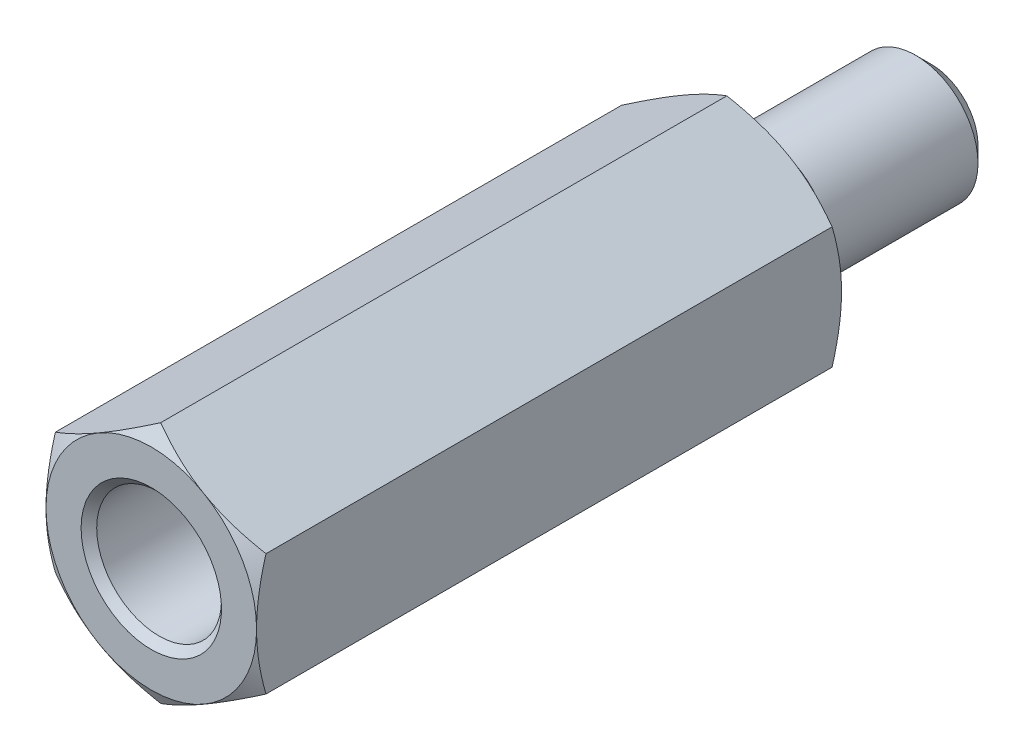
ISO-10303-21;
HEADER;
FILE_DESCRIPTION(('STEP AP214'),'2;1');
FILE_NAME('part.step','',(''),(''),'','','');
FILE_SCHEMA(('AUTOMOTIVE_DESIGN { 1 0 10303 214 1 1 1 1 }'));
ENDSEC;
DATA;
#1=APPLICATION_CONTEXT('core data for automotive mechanical design processes');
#2=APPLICATION_PROTOCOL_DEFINITION('international standard','automotive_design',2000,#1);
#3=PRODUCT_CONTEXT('',#1,'mechanical');
#4=PRODUCT('Part','Part','',(#3));
#5=PRODUCT_RELATED_PRODUCT_CATEGORY('part','',(#4));
#6=PRODUCT_DEFINITION_FORMATION('','',#4);
#7=PRODUCT_DEFINITION_CONTEXT('part definition',#1,'design');
#8=PRODUCT_DEFINITION('design','',#6,#7);
#9=PRODUCT_DEFINITION_SHAPE('','',#8);
#10=(LENGTH_UNIT() NAMED_UNIT(*) SI_UNIT(.MILLI.,.METRE.));
#11=(NAMED_UNIT(*) PLANE_ANGLE_UNIT() SI_UNIT($,.RADIAN.));
#12=(NAMED_UNIT(*) SI_UNIT($,.STERADIAN.) SOLID_ANGLE_UNIT());
#13=UNCERTAINTY_MEASURE_WITH_UNIT(LENGTH_MEASURE(1.E-05),#10,'distance_accuracy_value','');
#14=(GEOMETRIC_REPRESENTATION_CONTEXT(3) GLOBAL_UNCERTAINTY_ASSIGNED_CONTEXT((#13)) GLOBAL_UNIT_ASSIGNED_CONTEXT((#10,
#11,#12)) REPRESENTATION_CONTEXT('',''));
#15=CARTESIAN_POINT('',(0.,0.,0.));
#16=DIRECTION('',(0.,0.,1.));
#17=DIRECTION('',(1.,0.,0.));
#18=AXIS2_PLACEMENT_3D('',#15,#16,#17);
#19=CARTESIAN_POINT('',(16.,0.,0.));
#20=DIRECTION('',(0.,0.,-1.));
#21=DIRECTION('',(-1.,0.,0.));
#22=AXIS2_PLACEMENT_3D('',#19,#20,#21);
#23=PLANE('',#22);
#24=CARTESIAN_POINT('',(0.,0.,0.));
#25=DIRECTION('',(0.,0.,-1.));
#26=DIRECTION('',(-1.,0.,0.));
#27=AXIS2_PLACEMENT_3D('',#24,#25,#26);
#28=CIRCLE('',#27,13.5);
#29=CARTESIAN_POINT('',(-6.75,-11.6913429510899,0.));
#30=VERTEX_POINT('',#29);
#31=CARTESIAN_POINT('',(-13.5,0.,0.));
#32=VERTEX_POINT('',#31);
#33=EDGE_CURVE('E136',#30,#32,#28,.T.);
#34=ORIENTED_EDGE('',*,*,#33,.T.);
#35=CARTESIAN_POINT('',(-6.75,11.6913429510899,0.));
#36=VERTEX_POINT('',#35);
#37=EDGE_CURVE('E134',#32,#36,#28,.T.);
#38=ORIENTED_EDGE('',*,*,#37,.T.);
#39=CARTESIAN_POINT('',(6.75,11.6913429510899,0.));
#40=VERTEX_POINT('',#39);
#41=EDGE_CURVE('E113',#36,#40,#28,.T.);
#42=ORIENTED_EDGE('',*,*,#41,.T.);
#43=CARTESIAN_POINT('',(13.5,0.,0.));
#44=VERTEX_POINT('',#43);
#45=EDGE_CURVE('E103',#40,#44,#28,.T.);
#46=ORIENTED_EDGE('',*,*,#45,.T.);
#47=CARTESIAN_POINT('',(6.75,-11.6913429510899,0.));
#48=VERTEX_POINT('',#47);
#49=EDGE_CURVE('E29',#44,#48,#28,.T.);
#50=ORIENTED_EDGE('',*,*,#49,.T.);
#51=EDGE_CURVE('E37',#48,#30,#28,.T.);
#52=ORIENTED_EDGE('',*,*,#51,.T.);
#53=EDGE_LOOP('',(#34,#38,#42,#46,#50,#52));
#54=FACE_BOUND('',#53,.T.);
#55=CARTESIAN_POINT('',(0.,0.,0.));
#56=DIRECTION('',(0.,0.,1.));
#57=DIRECTION('',(1.,0.,0.));
#58=AXIS2_PLACEMENT_3D('',#55,#56,#57);
#59=CIRCLE('',#58,6.5);
#60=CARTESIAN_POINT('',(6.5,0.,0.));
#61=VERTEX_POINT('',#60);
#62=EDGE_CURVE('E252',#61,#61,#59,.T.);
#63=ORIENTED_EDGE('',*,*,#62,.T.);
#64=EDGE_LOOP('',(#63));
#65=FACE_BOUND('',#64,.T.);
#66=ADVANCED_FACE('F14',(#54,#65),#23,.T.);
#67=CARTESIAN_POINT('',(0.,0.,80.));
#68=DIRECTION('',(0.,0.,1.));
#69=DIRECTION('',(1.,0.,0.));
#70=AXIS2_PLACEMENT_3D('',#67,#68,#69);
#71=CYLINDRICAL_SURFACE('',#70,6.5);
#72=CARTESIAN_POINT('',(0.,0.,-4.));
#73=DIRECTION('',(0.,0.,1.));
#74=DIRECTION('',(1.,0.,0.));
#75=AXIS2_PLACEMENT_3D('',#72,#73,#74);
#76=CIRCLE('',#75,6.5);
#77=CARTESIAN_POINT('',(6.5,0.,-4.));
#78=VERTEX_POINT('',#77);
#79=EDGE_CURVE('E249',#78,#78,#76,.T.);
#80=ORIENTED_EDGE('',*,*,#79,.T.);
#81=EDGE_LOOP('',(#80));
#82=FACE_BOUND('',#81,.T.);
#83=ORIENTED_EDGE('',*,*,#62,.F.);
#84=EDGE_LOOP('',(#83));
#85=FACE_BOUND('',#84,.T.);
#86=ADVANCED_FACE('F331',(#82,#85),#71,.T.);
#87=CARTESIAN_POINT('',(6.5,0.,-4.));
#88=DIRECTION('',(0.,0.,1.));
#89=DIRECTION('',(1.,0.,0.));
#90=AXIS2_PLACEMENT_3D('',#87,#88,#89);
#91=PLANE('',#90);
#92=CARTESIAN_POINT('',(0.,0.,-4.));
#93=DIRECTION('',(0.,0.,1.));
#94=DIRECTION('',(1.,0.,0.));
#95=AXIS2_PLACEMENT_3D('',#92,#93,#94);
#96=CIRCLE('',#95,8.);
#97=CARTESIAN_POINT('',(8.,0.,-4.));
#98=VERTEX_POINT('',#97);
#99=EDGE_CURVE('E246',#98,#98,#96,.T.);
#100=ORIENTED_EDGE('',*,*,#99,.T.);
#101=EDGE_LOOP('',(#100));
#102=FACE_BOUND('',#101,.T.);
#103=ORIENTED_EDGE('',*,*,#79,.F.);
#104=EDGE_LOOP('',(#103));
#105=FACE_BOUND('',#104,.T.);
#106=ADVANCED_FACE('F336',(#102,#105),#91,.T.);
#107=CARTESIAN_POINT('',(0.,0.,80.));
#108=DIRECTION('',(0.,0.,1.));
#109=DIRECTION('',(1.,0.,0.));
#110=AXIS2_PLACEMENT_3D('',#107,#108,#109);
#111=CYLINDRICAL_SURFACE('',#110,8.);
#112=CARTESIAN_POINT('',(0.,0.,-23.));
#113=DIRECTION('',(0.,0.,1.));
#114=DIRECTION('',(1.,0.,0.));
#115=AXIS2_PLACEMENT_3D('',#112,#113,#114);
#116=CIRCLE('',#115,8.);
#117=CARTESIAN_POINT('',(8.,0.,-23.));
#118=VERTEX_POINT('',#117);
#119=EDGE_CURVE('E22',#118,#118,#116,.T.);
#120=ORIENTED_EDGE('',*,*,#119,.T.);
#121=EDGE_LOOP('',(#120));
#122=FACE_BOUND('',#121,.T.);
#123=ORIENTED_EDGE('',*,*,#99,.F.);
#124=EDGE_LOOP('',(#123));
#125=FACE_BOUND('',#124,.T.);
#126=ADVANCED_FACE('F360',(#122,#125),#111,.T.);
#127=CARTESIAN_POINT('',(0.,0.,-25.));
#128=DIRECTION('',(0.,0.,1.));
#129=DIRECTION('',(1.,0.,0.));
#130=AXIS2_PLACEMENT_3D('',#127,#128,#129);
#131=PLANE('',#130);
#132=CARTESIAN_POINT('',(0.,0.,-25.));
#133=DIRECTION('',(0.,0.,1.));
#134=DIRECTION('',(1.,0.,0.));
#135=AXIS2_PLACEMENT_3D('',#132,#133,#134);
#136=CIRCLE('',#135,6.);
#137=CARTESIAN_POINT('',(6.,0.,-25.));
#138=VERTEX_POINT('',#137);
#139=EDGE_CURVE('E9',#138,#138,#136,.F.);
#140=ORIENTED_EDGE('',*,*,#139,.T.);
#141=EDGE_LOOP('',(#140));
#142=FACE_BOUND('',#141,.T.);
#143=ADVANCED_FACE('F364',(#142),#131,.F.);
#144=CARTESIAN_POINT('',(0.,0.,3.82159490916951));
#145=DIRECTION('',(0.,0.,1.));
#146=DIRECTION('',(1.,0.,0.));
#147=AXIS2_PLACEMENT_3D('',#144,#145,#146);
#148=CONICAL_SURFACE('',#147,20.1191965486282,1.0471975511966);
#149=ORIENTED_EDGE('',*,*,#41,.F.);
#150=CARTESIAN_POINT('',(-13.5002,7.79411316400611,1.20583803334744));
#151=CARTESIAN_POINT('',(-13.2034751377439,7.96542734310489,1.10693600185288));
#152=CARTESIAN_POINT('',(-12.9055928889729,8.13740973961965,1.01252193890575));
#153=CARTESIAN_POINT('',(-12.3074397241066,8.48275363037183,0.833917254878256));
#154=CARTESIAN_POINT('',(-12.0071680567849,8.65611555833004,0.749729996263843));
#155=CARTESIAN_POINT('',(-11.403655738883,9.00455355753,0.592710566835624));
#156=CARTESIAN_POINT('',(-11.1004098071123,9.17963267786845,0.519905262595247));
#157=CARTESIAN_POINT('',(-10.4918107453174,9.53100751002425,0.387213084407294));
#158=CARTESIAN_POINT('',(-10.1864577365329,9.70730315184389,0.327325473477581));
#159=CARTESIAN_POINT('',(-9.58146884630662,10.0565936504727,0.223015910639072));
#160=CARTESIAN_POINT('',(-9.28187788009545,10.2295625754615,0.178248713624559));
#161=CARTESIAN_POINT('',(-8.68132315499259,10.5762930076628,0.10318393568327));
#162=CARTESIAN_POINT('',(-8.38035936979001,10.7500545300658,0.0728866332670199));
#163=CARTESIAN_POINT('',(-7.77792621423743,11.0978694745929,0.0275266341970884));
#164=CARTESIAN_POINT('',(-7.47645787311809,11.2719223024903,0.0124458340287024));
#165=CARTESIAN_POINT('',(-6.87324289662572,11.6201886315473,-0.00215683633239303));
#166=CARTESIAN_POINT('',(-6.57149627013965,11.7944021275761,-0.00167918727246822));
#167=CARTESIAN_POINT('',(-6.00738189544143,12.1200937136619,0.0137483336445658));
#168=CARTESIAN_POINT('',(-5.74497394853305,12.2715950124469,0.0268164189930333));
#169=CARTESIAN_POINT('',(-5.22076165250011,12.5742491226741,0.0644725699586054));
#170=CARTESIAN_POINT('',(-4.95895734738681,12.7254019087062,0.0890614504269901));
#171=CARTESIAN_POINT('',(-4.43609453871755,13.0272768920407,0.149330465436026));
#172=CARTESIAN_POINT('',(-4.1750368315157,13.1779986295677,0.185019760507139));
#173=CARTESIAN_POINT('',(-3.65414530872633,13.4787354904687,0.266863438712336));
#174=CARTESIAN_POINT('',(-3.39431157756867,13.6287505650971,0.313018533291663));
#175=CARTESIAN_POINT('',(-2.60557180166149,14.0841296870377,0.468349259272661));
#176=CARTESIAN_POINT('',(-2.07894982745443,14.3881750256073,0.593013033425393));
#177=CARTESIAN_POINT('',(-1.03355849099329,14.9917319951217,0.875948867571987));
#178=CARTESIAN_POINT('',(-0.51477574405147,15.2912513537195,1.0341544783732));
#179=CARTESIAN_POINT('',(0.000200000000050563,15.5885727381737,1.20583803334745));
#180=B_SPLINE_CURVE_WITH_KNOTS('',3,(#150,#151,#152,#153,#154,#155,#156,#157,#158,#159,#160,
#161,#162,#163,#164,#165,#166,#167,#168,#169,#170,#171,#172,#173,#174,#175,#176,#177,#178,#179),
.UNSPECIFIED.,.F.,.F.,(4,2,2,2,2,2,2,2,2,2,2,2,2,2,4),(0.,1.0698794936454,2.14010980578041,
3.21282939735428,4.28548777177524,5.33167033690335,6.3778730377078,7.42282956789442,
8.46775380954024,9.37738732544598,10.2870851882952,11.1975357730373,12.1080482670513,
13.9691139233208,15.8265265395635),.UNSPECIFIED.);
#181=CARTESIAN_POINT('',(0.,15.5884572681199,1.20577136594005));
#182=VERTEX_POINT('',#181);
#183=EDGE_CURVE('E121',#36,#182,#180,.T.);
#184=ORIENTED_EDGE('',*,*,#183,.T.);
#185=CARTESIAN_POINT('',(13.5002,7.79411316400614,1.20583803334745));
#186=CARTESIAN_POINT('',(13.2034751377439,7.96542734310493,1.10693600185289));
#187=CARTESIAN_POINT('',(12.9055928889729,8.13740973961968,1.01252193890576));
#188=CARTESIAN_POINT('',(12.3074397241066,8.48275363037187,0.833917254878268));
#189=CARTESIAN_POINT('',(12.0071680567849,8.65611555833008,0.749729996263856));
#190=CARTESIAN_POINT('',(11.403655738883,9.00455355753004,0.592710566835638));
#191=CARTESIAN_POINT('',(11.1004098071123,9.1796326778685,0.519905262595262));
#192=CARTESIAN_POINT('',(10.4918107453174,9.5310075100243,0.38721308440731));
#193=CARTESIAN_POINT('',(10.1864577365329,9.70730315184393,0.327325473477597));
#194=CARTESIAN_POINT('',(9.58146884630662,10.0565936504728,0.223015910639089));
#195=CARTESIAN_POINT('',(9.28187788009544,10.2295625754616,0.178248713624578));
#196=CARTESIAN_POINT('',(8.68132315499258,10.5762930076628,0.103183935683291));
#197=CARTESIAN_POINT('',(8.38035936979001,10.7500545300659,0.0728866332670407));
#198=CARTESIAN_POINT('',(7.77792621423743,11.0978694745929,0.0275266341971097));
#199=CARTESIAN_POINT('',(7.47645787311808,11.2719223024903,0.0124458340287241));
#200=CARTESIAN_POINT('',(6.87324289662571,11.6201886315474,-0.00215683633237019));
#201=CARTESIAN_POINT('',(6.57149627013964,11.7944021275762,-0.00167918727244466));
#202=CARTESIAN_POINT('',(6.00738189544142,12.1200937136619,0.013748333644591));
#203=CARTESIAN_POINT('',(5.74497394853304,12.271595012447,0.026816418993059));
#204=CARTESIAN_POINT('',(5.22076165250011,12.5742491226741,0.0644725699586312));
#205=CARTESIAN_POINT('',(4.95895734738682,12.7254019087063,0.0890614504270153));
#206=CARTESIAN_POINT('',(4.43609453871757,13.0272768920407,0.149330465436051));
#207=CARTESIAN_POINT('',(4.17503683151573,13.1779986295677,0.185019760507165));
#208=CARTESIAN_POINT('',(3.65414530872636,13.4787354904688,0.266863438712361));
#209=CARTESIAN_POINT('',(3.39431157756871,13.6287505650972,0.313018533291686));
#210=CARTESIAN_POINT('',(2.60557180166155,14.0841296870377,0.468349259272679));
#211=CARTESIAN_POINT('',(2.0789498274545,14.3881750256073,0.593013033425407));
#212=CARTESIAN_POINT('',(1.03355849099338,14.9917319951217,0.875948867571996));
#213=CARTESIAN_POINT('',(0.514775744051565,15.2912513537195,1.03415447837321));
#214=CARTESIAN_POINT('',(-0.00019999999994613,15.5885727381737,1.20583803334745));
#215=B_SPLINE_CURVE_WITH_KNOTS('',3,(#185,#186,#187,#188,#189,#190,#191,#192,#193,#194,#195,
#196,#197,#198,#199,#200,#201,#202,#203,#204,#205,#206,#207,#208,#209,#210,#211,#212,#213,#214),
.UNSPECIFIED.,.F.,.F.,(4,2,2,2,2,2,2,2,2,2,2,2,2,2,4),(0.,1.0698794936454,2.14010980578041,
3.21282939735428,4.28548777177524,5.33167033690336,6.37787303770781,7.42282956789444,
8.46775380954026,9.37738732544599,10.2870851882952,11.1975357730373,12.1080482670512,
13.9691139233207,15.8265265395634),.UNSPECIFIED.);
#216=EDGE_CURVE('E118',#40,#182,#215,.T.);
#217=ORIENTED_EDGE('',*,*,#216,.F.);
#218=EDGE_LOOP('',(#149,#184,#217));
#219=FACE_BOUND('',#218,.T.);
#220=ADVANCED_FACE('F119',(#219),#148,.T.);
#221=CARTESIAN_POINT('',(-13.5,-21.0364727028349,6.63702430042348));
#222=CARTESIAN_POINT('',(-13.5,-20.741249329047,6.49357783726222));
#223=CARTESIAN_POINT('',(-13.5,-20.4456822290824,6.35083912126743));
#224=CARTESIAN_POINT('',(-13.5,-19.8537888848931,6.06693727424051));
#225=CARTESIAN_POINT('',(-13.5,-19.5574626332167,5.92577415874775));
#226=CARTESIAN_POINT('',(-13.5,-18.6671600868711,5.50485179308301));
#227=CARTESIAN_POINT('',(-13.5,-18.0719457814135,5.22770131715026));
#228=CARTESIAN_POINT('',(-13.5,-16.8743759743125,4.68054316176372));
#229=CARTESIAN_POINT('',(-13.5,-16.2719992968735,4.41058172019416));
#230=CARTESIAN_POINT('',(-13.5,-15.0624906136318,3.88156861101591));
#231=CARTESIAN_POINT('',(-13.5,-14.4553588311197,3.62251643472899));
#232=CARTESIAN_POINT('',(-13.5,-13.2153651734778,3.10993400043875));
#233=CARTESIAN_POINT('',(-13.5,-12.5823123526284,2.8568632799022));
#234=CARTESIAN_POINT('',(-13.5,-11.3088329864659,2.36963261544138));
#235=CARTESIAN_POINT('',(-13.5,-10.6684056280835,2.13547477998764));
#236=CARTESIAN_POINT('',(-13.5,-9.38034573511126,1.69214745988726));
#237=CARTESIAN_POINT('',(-13.5,-8.73273045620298,1.48292823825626));
#238=CARTESIAN_POINT('',(-13.5,-7.42814922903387,1.09611323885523));
#239=CARTESIAN_POINT('',(-13.5,-6.77118626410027,0.918507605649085));
#240=CARTESIAN_POINT('',(-13.5,-5.78043818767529,0.682675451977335));
#241=CARTESIAN_POINT('',(-13.5,-5.45023238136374,0.60932305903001));
#242=CARTESIAN_POINT('',(-13.5,-4.78754599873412,0.473673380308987));
#243=CARTESIAN_POINT('',(-13.5,-4.45506546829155,0.411375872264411));
#244=CARTESIAN_POINT('',(-13.5,-3.78805148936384,0.2989293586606));
#245=CARTESIAN_POINT('',(-13.5,-3.45351807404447,0.248780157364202));
#246=CARTESIAN_POINT('',(-13.5,-2.78274465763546,0.161626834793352));
#247=CARTESIAN_POINT('',(-13.5,-2.446504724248,0.124622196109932));
#248=CARTESIAN_POINT('',(-13.5,-1.77722162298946,0.0649627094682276));
#249=CARTESIAN_POINT('',(-13.5,-1.44419487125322,0.0421248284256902));
#250=CARTESIAN_POINT('',(-13.5,-0.777474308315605,0.0105582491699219));
#251=CARTESIAN_POINT('',(-13.5,-0.443780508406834,0.00182931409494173));
#252=CARTESIAN_POINT('',(-13.5,0.223677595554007,-0.00131136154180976));
#253=CARTESIAN_POINT('',(-13.5,0.557441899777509,0.00427693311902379));
#254=CARTESIAN_POINT('',(-13.5,1.22443524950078,0.0296331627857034));
#255=CARTESIAN_POINT('',(-13.5,1.55766427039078,0.0494017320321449));
#256=CARTESIAN_POINT('',(-13.5,2.35550633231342,0.113287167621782));
#257=CARTESIAN_POINT('',(-13.5,2.81960349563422,0.163964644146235));
#258=CARTESIAN_POINT('',(-13.5,3.74442192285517,0.290088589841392));
#259=CARTESIAN_POINT('',(-13.5,4.20514273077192,0.365538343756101));
#260=CARTESIAN_POINT('',(-13.5,5.12274614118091,0.538523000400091));
#261=CARTESIAN_POINT('',(-13.5,5.57962552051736,0.636074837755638));
#262=CARTESIAN_POINT('',(-13.5,6.48883480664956,0.850281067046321));
#263=CARTESIAN_POINT('',(-13.5,6.94116477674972,0.966935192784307));
#264=CARTESIAN_POINT('',(-13.5,7.85127232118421,1.21927224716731));
#265=CARTESIAN_POINT('',(-13.5,8.30894803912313,1.35531999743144));
#266=CARTESIAN_POINT('',(-13.5,9.21979234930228,1.64167169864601));
#267=CARTESIAN_POINT('',(-13.5,9.67296091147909,1.7919757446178));
#268=CARTESIAN_POINT('',(-13.5,10.5750112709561,2.10443613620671));
#269=CARTESIAN_POINT('',(-13.5,11.0238943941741,2.26658867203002));
#270=CARTESIAN_POINT('',(-13.5,11.917927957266,2.60081884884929));
#271=CARTESIAN_POINT('',(-13.5,12.3630784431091,2.7728963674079));
#272=CARTESIAN_POINT('',(-13.5,13.4219789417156,3.19364164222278));
#273=CARTESIAN_POINT('',(-13.5,14.0342029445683,3.44614438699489));
#274=CARTESIAN_POINT('',(-13.5,15.2533539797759,3.96366632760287));
#275=CARTESIAN_POINT('',(-13.5,15.8602806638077,4.22868633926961));
#276=CARTESIAN_POINT('',(-13.5,17.0698359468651,4.76870991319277));
#277=CARTESIAN_POINT('',(-13.5,17.6724634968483,5.04371581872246));
#278=CARTESIAN_POINT('',(-13.5,18.8740025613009,5.60167388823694));
#279=CARTESIAN_POINT('',(-13.5,19.4729141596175,5.88462587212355));
#280=CARTESIAN_POINT('',(-13.5,20.6683249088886,6.45730099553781));
#281=CARTESIAN_POINT('',(-13.5,21.2648205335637,6.74703148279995));
#282=CARTESIAN_POINT('',(-13.5,22.4552119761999,7.33178414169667));
#283=CARTESIAN_POINT('',(-13.5,23.0491077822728,7.6268063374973));
#284=CARTESIAN_POINT('',(-13.5,24.2346222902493,8.2211862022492));
#285=CARTESIAN_POINT('',(-13.5,24.8262412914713,8.52054327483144));
#286=CARTESIAN_POINT('',(-13.5,26.0076146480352,9.12291639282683));
#287=CARTESIAN_POINT('',(-13.5,26.597368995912,9.42593245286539));
#288=CARTESIAN_POINT('',(-13.5,28.2636953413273,10.2875860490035));
#289=CARTESIAN_POINT('',(-13.5,29.3384058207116,10.8498233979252));
#290=CARTESIAN_POINT('',(-13.5,31.4838267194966,11.9819569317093));
#291=CARTESIAN_POINT('',(-13.5,32.5545369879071,12.5518534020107));
#292=CARTESIAN_POINT('',(-13.5,34.6900615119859,13.6960213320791));
#293=CARTESIAN_POINT('',(-13.5,35.7548838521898,14.2702777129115));
#294=CARTESIAN_POINT('',(-13.5,37.3502347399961,15.1350590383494));
#295=CARTESIAN_POINT('',(-13.5,37.8816897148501,15.4238774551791));
#296=CARTESIAN_POINT('',(-13.5,38.9440438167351,16.0025328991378));
#297=CARTESIAN_POINT('',(-13.5,39.4749429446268,16.2923699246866));
#298=CARTESIAN_POINT('',(-13.5,40.0055958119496,16.5826572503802));
#299=B_SPLINE_CURVE_WITH_KNOTS('',3,(#221,#222,#223,#224,#225,#226,#227,#228,#229,#230,#231,
#232,#233,#234,#235,#236,#237,#238,#239,#240,#241,#242,#243,#244,#245,#246,#247,#248,#249,#250,
#251,#252,#253,#254,#255,#256,#257,#258,#259,#260,#261,#262,#263,#264,#265,#266,#267,#268,#269,
#270,#271,#272,#273,#274,#275,#276,#277,#278,#279,#280,#281,#282,#283,#284,#285,#286,#287,#288,
#289,#290,#291,#292,#293,#294,#295,#296,#297,#298),.UNSPECIFIED.,.F.,.F.,(4,2,2,2,2,2,2,2,2,2,2,
2,2,2,2,2,2,2,2,2,2,2,2,2,2,2,2,2,2,2,2,2,2,2,2,2,2,2,4),(0.,0.984682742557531,1.96937518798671,
3.93904632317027,5.91927296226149,7.89940716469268,9.94446512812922,11.9897507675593,
14.0308865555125,16.0713849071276,17.0859948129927,18.1005843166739,19.1151574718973,
20.1296906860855,21.1308272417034,22.131946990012,23.1330692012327,24.1342361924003,
25.5340314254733,26.9340123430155,28.3350695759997,29.7361072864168,31.1682352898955,
32.6003728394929,34.0320519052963,35.4637133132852,37.4502749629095,39.4369662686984,
41.4241268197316,43.4112423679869,45.4006220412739,47.3900108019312,49.3791284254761,
51.3682540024,55.0068910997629,58.6456641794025,62.2750502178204,64.0896414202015,
65.9042298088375),.UNSPECIFIED.);
#300=CARTESIAN_POINT('',(-13.5,7.79422863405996,1.20577136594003));
#301=VERTEX_POINT('',#300);
#302=EDGE_CURVE('E135',#32,#301,#299,.T.);
#303=ORIENTED_EDGE('',*,*,#302,.T.);
#304=EDGE_CURVE('E262',#301,#36,#180,.T.);
#305=ORIENTED_EDGE('',*,*,#304,.T.);
#306=ORIENTED_EDGE('',*,*,#37,.F.);
#307=EDGE_LOOP('',(#303,#305,#306));
#308=FACE_BOUND('',#307,.T.);
#309=ADVANCED_FACE('F154',(#308),#148,.T.);
#310=CARTESIAN_POINT('',(-13.5,-7.79422863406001,1.20577136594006));
#311=VERTEX_POINT('',#310);
#312=EDGE_CURVE('E145',#311,#32,#299,.T.);
#313=ORIENTED_EDGE('',*,*,#312,.T.);
#314=ORIENTED_EDGE('',*,*,#33,.F.);
#315=CARTESIAN_POINT('',(-13.5002,-7.79411316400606,1.20583803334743));
#316=CARTESIAN_POINT('',(-13.2034751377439,-7.96542734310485,1.10693600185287));
#317=CARTESIAN_POINT('',(-12.9055928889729,-8.1374097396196,1.01252193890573));
#318=CARTESIAN_POINT('',(-12.3074397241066,-8.48275363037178,0.833917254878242));
#319=CARTESIAN_POINT('',(-12.0071680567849,-8.65611555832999,0.749729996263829));
#320=CARTESIAN_POINT('',(-11.403655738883,-9.00455355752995,0.59271056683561));
#321=CARTESIAN_POINT('',(-11.1004098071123,-9.1796326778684,0.519905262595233));
#322=CARTESIAN_POINT('',(-10.4918107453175,-9.5310075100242,0.387213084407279));
#323=CARTESIAN_POINT('',(-10.1864577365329,-9.70730315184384,0.327325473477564));
#324=CARTESIAN_POINT('',(-9.58146884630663,-10.0565936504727,0.223015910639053));
#325=CARTESIAN_POINT('',(-9.28187788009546,-10.2295625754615,0.178248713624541));
#326=CARTESIAN_POINT('',(-8.6813231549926,-10.5762930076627,0.103183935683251));
#327=CARTESIAN_POINT('',(-8.38035936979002,-10.7500545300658,0.0728866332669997));
#328=CARTESIAN_POINT('',(-7.77792621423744,-11.0978694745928,0.0275266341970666));
#329=CARTESIAN_POINT('',(-7.4764578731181,-11.2719223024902,0.01244583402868));
#330=CARTESIAN_POINT('',(-6.87324289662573,-11.6201886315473,-0.00215683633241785));
#331=CARTESIAN_POINT('',(-6.57149627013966,-11.7944021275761,-0.00167918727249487));
#332=CARTESIAN_POINT('',(-6.00738189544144,-12.1200937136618,0.013748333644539));
#333=CARTESIAN_POINT('',(-5.74497394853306,-12.2715950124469,0.0268164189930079));
#334=CARTESIAN_POINT('',(-5.22076165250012,-12.574249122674,0.0644725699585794));
#335=CARTESIAN_POINT('',(-4.95895734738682,-12.7254019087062,0.0890614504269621));
#336=CARTESIAN_POINT('',(-4.43609453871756,-13.0272768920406,0.149330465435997));
#337=CARTESIAN_POINT('',(-4.17503683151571,-13.1779986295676,0.185019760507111));
#338=CARTESIAN_POINT('',(-3.65414530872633,-13.4787354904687,0.266863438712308));
#339=CARTESIAN_POINT('',(-3.39431157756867,-13.6287505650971,0.313018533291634));
#340=CARTESIAN_POINT('',(-2.6055718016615,-14.0841296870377,0.46834925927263));
#341=CARTESIAN_POINT('',(-2.07894982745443,-14.3881750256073,0.593013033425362));
#342=CARTESIAN_POINT('',(-1.03355849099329,-14.9917319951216,0.875948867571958));
#343=CARTESIAN_POINT('',(-0.514775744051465,-15.2912513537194,1.03415447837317));
#344=CARTESIAN_POINT('',(0.000200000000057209,-15.5885727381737,1.20583803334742));
#345=B_SPLINE_CURVE_WITH_KNOTS('',3,(#315,#316,#317,#318,#319,#320,#321,#322,#323,#324,#325,
#326,#327,#328,#329,#330,#331,#332,#333,#334,#335,#336,#337,#338,#339,#340,#341,#342,#343,#344),
.UNSPECIFIED.,.F.,.F.,(4,2,2,2,2,2,2,2,2,2,2,2,2,2,4),(0.,1.0698794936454,2.1401098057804,
3.21282939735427,4.28548777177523,5.33167033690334,6.37787303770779,7.42282956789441,
8.46775380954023,9.37738732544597,10.2870851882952,11.1975357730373,12.1080482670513,
13.9691139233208,15.8265265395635),.UNSPECIFIED.);
#346=EDGE_CURVE('E124',#311,#30,#345,.T.);
#347=ORIENTED_EDGE('',*,*,#346,.F.);
#348=EDGE_LOOP('',(#313,#314,#347));
#349=FACE_BOUND('',#348,.T.);
#350=ADVANCED_FACE('F158',(#349),#148,.T.);
#351=CARTESIAN_POINT('',(13.5002,-7.79411316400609,1.20583803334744));
#352=CARTESIAN_POINT('',(13.2034751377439,-7.96542734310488,1.10693600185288));
#353=CARTESIAN_POINT('',(12.9055928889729,-8.13740973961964,1.01252193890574));
#354=CARTESIAN_POINT('',(12.3074397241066,-8.48275363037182,0.833917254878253));
#355=CARTESIAN_POINT('',(12.0071680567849,-8.65611555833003,0.749729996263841));
#356=CARTESIAN_POINT('',(11.403655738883,-9.00455355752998,0.592710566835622));
#357=CARTESIAN_POINT('',(11.1004098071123,-9.17963267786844,0.519905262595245));
#358=CARTESIAN_POINT('',(10.4918107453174,-9.53100751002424,0.387213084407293));
#359=CARTESIAN_POINT('',(10.1864577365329,-9.70730315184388,0.32732547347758));
#360=CARTESIAN_POINT('',(9.58146884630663,-10.0565936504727,0.223015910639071));
#361=CARTESIAN_POINT('',(9.28187788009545,-10.2295625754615,0.178248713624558));
#362=CARTESIAN_POINT('',(8.6813231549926,-10.5762930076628,0.10318393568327));
#363=CARTESIAN_POINT('',(8.38035936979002,-10.7500545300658,0.0728866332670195));
#364=CARTESIAN_POINT('',(7.77792621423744,-11.0978694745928,0.0275266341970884));
#365=CARTESIAN_POINT('',(7.4764578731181,-11.2719223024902,0.0124458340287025));
#366=CARTESIAN_POINT('',(6.87324289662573,-11.6201886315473,-0.00215683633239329));
#367=CARTESIAN_POINT('',(6.57149627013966,-11.7944021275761,-0.001679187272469));
#368=CARTESIAN_POINT('',(6.00738189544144,-12.1200937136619,0.0137483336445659));
#369=CARTESIAN_POINT('',(5.74497394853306,-12.2715950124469,0.0268164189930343));
#370=CARTESIAN_POINT('',(5.22076165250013,-12.5742491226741,0.0644725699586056));
#371=CARTESIAN_POINT('',(4.95895734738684,-12.7254019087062,0.0890614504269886));
#372=CARTESIAN_POINT('',(4.43609453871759,-13.0272768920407,0.149330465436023));
#373=CARTESIAN_POINT('',(4.17503683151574,-13.1779986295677,0.185019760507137));
#374=CARTESIAN_POINT('',(3.65414530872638,-13.4787354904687,0.266863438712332));
#375=CARTESIAN_POINT('',(3.39431157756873,-13.6287505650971,0.313018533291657));
#376=CARTESIAN_POINT('',(2.60557180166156,-14.0841296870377,0.468349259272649));
#377=CARTESIAN_POINT('',(2.07894982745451,-14.3881750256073,0.593013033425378));
#378=CARTESIAN_POINT('',(1.03355849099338,-14.9917319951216,0.875948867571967));
#379=CARTESIAN_POINT('',(0.514775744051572,-15.2912513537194,1.03415447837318));
#380=CARTESIAN_POINT('',(-0.000199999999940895,-15.5885727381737,1.20583803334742));
#381=B_SPLINE_CURVE_WITH_KNOTS('',3,(#351,#352,#353,#354,#355,#356,#357,#358,#359,#360,#361,
#362,#363,#364,#365,#366,#367,#368,#369,#370,#371,#372,#373,#374,#375,#376,#377,#378,#379,#380),
.UNSPECIFIED.,.F.,.F.,(4,2,2,2,2,2,2,2,2,2,2,2,2,2,4),(0.,1.0698794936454,2.1401098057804,
3.21282939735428,4.28548777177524,5.33167033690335,6.3778730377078,7.42282956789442,
8.46775380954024,9.37738732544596,10.2870851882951,11.1975357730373,12.1080482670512,
13.9691139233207,15.8265265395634),.UNSPECIFIED.);
#382=CARTESIAN_POINT('',(0.,-15.5884572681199,1.20577136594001));
#383=VERTEX_POINT('',#382);
#384=EDGE_CURVE('E184',#48,#383,#381,.T.);
#385=ORIENTED_EDGE('',*,*,#384,.T.);
#386=EDGE_CURVE('E130',#30,#383,#345,.T.);
#387=ORIENTED_EDGE('',*,*,#386,.F.);
#388=ORIENTED_EDGE('',*,*,#51,.F.);
#389=EDGE_LOOP('',(#385,#387,#388));
#390=FACE_BOUND('',#389,.T.);
#391=ADVANCED_FACE('F161',(#390),#148,.T.);
#392=CARTESIAN_POINT('',(13.5,-7.79422863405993,1.20577136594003));
#393=VERTEX_POINT('',#392);
#394=EDGE_CURVE('E190',#393,#48,#381,.T.);
#395=ORIENTED_EDGE('',*,*,#394,.T.);
#396=ORIENTED_EDGE('',*,*,#49,.F.);
#397=CARTESIAN_POINT('',(13.5,-21.036472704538,6.63702430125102));
#398=CARTESIAN_POINT('',(13.5,-20.7412493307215,6.49357783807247));
#399=CARTESIAN_POINT('',(13.5,-20.4456822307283,6.35083912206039));
#400=CARTESIAN_POINT('',(13.5,-19.8537888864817,6.06693727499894));
#401=CARTESIAN_POINT('',(13.5,-19.5574626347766,5.92577415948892));
#402=CARTESIAN_POINT('',(13.5,-18.667160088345,5.50485179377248));
#403=CARTESIAN_POINT('',(13.5,-18.0719457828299,5.22770131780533));
#404=CARTESIAN_POINT('',(13.5,-16.8743759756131,4.68054316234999));
#405=CARTESIAN_POINT('',(13.5,-16.2719992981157,4.41058172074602));
#406=CARTESIAN_POINT('',(13.5,-15.062490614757,3.88156861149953));
#407=CARTESIAN_POINT('',(13.5,-14.4553588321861,3.62251643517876));
#408=CARTESIAN_POINT('',(13.5,-13.2153651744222,3.10993400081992));
#409=CARTESIAN_POINT('',(13.5,-12.5823123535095,2.85686328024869));
#410=CARTESIAN_POINT('',(13.5,-11.3088329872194,2.36963261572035));
#411=CARTESIAN_POINT('',(13.5,-10.6684056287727,2.13547478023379));
#412=CARTESIAN_POINT('',(13.5,-9.38034573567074,1.69214746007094));
#413=CARTESIAN_POINT('',(13.5,-8.73273045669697,1.48292823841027));
#414=CARTESIAN_POINT('',(13.5,-7.42814922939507,1.0961132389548));
#415=CARTESIAN_POINT('',(13.5,-6.77118626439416,0.918507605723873));
#416=CARTESIAN_POINT('',(13.5,-5.78043818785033,0.682675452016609));
#417=CARTESIAN_POINT('',(13.5,-5.45023238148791,0.609323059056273));
#418=CARTESIAN_POINT('',(13.5,-4.78754599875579,0.473673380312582));
#419=CARTESIAN_POINT('',(13.5,-4.45506546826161,0.411375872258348));
#420=CARTESIAN_POINT('',(13.5,-3.78805148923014,0.298929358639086));
#421=CARTESIAN_POINT('',(13.5,-3.45351807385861,0.248780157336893));
#422=CARTESIAN_POINT('',(13.5,-2.78274465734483,0.161626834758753));
#423=CARTESIAN_POINT('',(13.5,-2.44650472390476,0.124622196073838));
#424=CARTESIAN_POINT('',(13.5,-1.77722162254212,0.0649627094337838));
#425=CARTESIAN_POINT('',(13.5,-1.44419487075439,0.0421248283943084));
#426=CARTESIAN_POINT('',(13.5,-0.777474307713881,0.0105582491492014));
#427=CARTESIAN_POINT('',(13.5,-0.443780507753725,0.00182931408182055));
#428=CARTESIAN_POINT('',(13.5,0.223677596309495,-0.00131136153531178));
#429=CARTESIAN_POINT('',(13.5,0.55744190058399,0.0042769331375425));
#430=CARTESIAN_POINT('',(13.5,1.22443525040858,0.0296331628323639));
#431=CARTESIAN_POINT('',(13.5,1.5576642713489,0.0494017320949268));
#432=CARTESIAN_POINT('',(13.5,2.35550633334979,0.113287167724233));
#433=CARTESIAN_POINT('',(13.5,2.81960349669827,0.163964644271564));
#434=CARTESIAN_POINT('',(13.5,3.74442192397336,0.290088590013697));
#435=CARTESIAN_POINT('',(13.5,4.20514273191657,0.365538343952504));
#436=CARTESIAN_POINT('',(13.5,5.1227461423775,0.538523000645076));
#437=CARTESIAN_POINT('',(13.5,5.57962552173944,0.636074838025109));
#438=CARTESIAN_POINT('',(13.5,6.48883480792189,0.850281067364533));
#439=CARTESIAN_POINT('',(13.5,6.94116477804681,0.966935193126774));
#440=CARTESIAN_POINT('',(13.5,7.85127232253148,1.21927224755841));
#441=CARTESIAN_POINT('',(13.5,8.30894804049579,1.35531999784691));
#442=CARTESIAN_POINT('',(13.5,9.21979235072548,1.64167169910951));
#443=CARTESIAN_POINT('',(13.5,9.67296091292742,1.79197574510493));
#444=CARTESIAN_POINT('',(13.5,10.5750112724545,2.10443613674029));
#445=CARTESIAN_POINT('',(13.5,11.0238943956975,2.26658867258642));
#446=CARTESIAN_POINT('',(13.5,11.9179279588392,2.60081884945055));
#447=CARTESIAN_POINT('',(13.5,12.3630784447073,2.7728963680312));
#448=CARTESIAN_POINT('',(13.5,13.4219789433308,3.19364164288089));
#449=CARTESIAN_POINT('',(13.5,14.034202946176,3.44614438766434));
#450=CARTESIAN_POINT('',(13.5,15.2533539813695,3.96366632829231));
#451=CARTESIAN_POINT('',(13.5,15.8602806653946,4.2286863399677));
#452=CARTESIAN_POINT('',(13.5,17.0698359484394,4.76870991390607));
#453=CARTESIAN_POINT('',(13.5,17.6724634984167,5.04371581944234));
#454=CARTESIAN_POINT('',(13.5,18.874002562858,5.60167388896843));
#455=CARTESIAN_POINT('',(13.5,19.4729141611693,5.88462587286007));
#456=CARTESIAN_POINT('',(13.5,20.66832491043,6.45730099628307));
#457=CARTESIAN_POINT('',(13.5,21.2648205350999,6.74703148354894));
#458=CARTESIAN_POINT('',(13.5,22.4552119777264,7.33178414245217));
#459=CARTESIAN_POINT('',(13.5,23.0491077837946,7.6268063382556));
#460=CARTESIAN_POINT('',(13.5,24.2346222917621,8.22118620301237));
#461=CARTESIAN_POINT('',(13.5,24.8262412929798,8.5205432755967));
#462=CARTESIAN_POINT('',(13.5,26.0076146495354,9.12291639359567));
#463=CARTESIAN_POINT('',(13.5,26.5973689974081,9.42593245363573));
#464=CARTESIAN_POINT('',(13.5,28.2636953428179,10.2875860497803));
#465=CARTESIAN_POINT('',(13.5,29.338405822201,10.8498233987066));
#466=CARTESIAN_POINT('',(13.5,31.4838267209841,11.9819569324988));
#467=CARTESIAN_POINT('',(13.5,32.5545369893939,12.5518534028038));
#468=CARTESIAN_POINT('',(13.5,34.6900615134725,13.6960213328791));
#469=CARTESIAN_POINT('',(13.5,35.754883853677,14.2702777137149));
#470=CARTESIAN_POINT('',(13.5,37.3502347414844,15.1350590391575));
#471=CARTESIAN_POINT('',(13.5,37.8816897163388,15.4238774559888));
#472=CARTESIAN_POINT('',(13.5,38.9440438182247,16.0025328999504));
#473=CARTESIAN_POINT('',(13.5,39.4749429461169,16.2923699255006));
#474=CARTESIAN_POINT('',(13.5,40.0055958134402,16.5826572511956));
#475=B_SPLINE_CURVE_WITH_KNOTS('',3,(#397,#398,#399,#400,#401,#402,#403,#404,#405,#406,#407,
#408,#409,#410,#411,#412,#413,#414,#415,#416,#417,#418,#419,#420,#421,#422,#423,#424,#425,#426,
#427,#428,#429,#430,#431,#432,#433,#434,#435,#436,#437,#438,#439,#440,#441,#442,#443,#444,#445,
#446,#447,#448,#449,#450,#451,#452,#453,#454,#455,#456,#457,#458,#459,#460,#461,#462,#463,#464,
#465,#466,#467,#468,#469,#470,#471,#472,#473,#474),.UNSPECIFIED.,.F.,.F.,(4,2,2,2,2,2,2,2,2,2,2,
2,2,2,2,2,2,2,2,2,2,2,2,2,2,2,2,2,2,2,2,2,2,2,2,2,2,2,4),(0.,0.984682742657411,1.96937518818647,
3.93904632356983,5.919272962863,7.89940716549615,9.94446512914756,11.9897507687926,
14.03088655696,16.0713849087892,17.0859948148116,18.1005843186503,19.1151574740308,
20.1296906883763,21.1308272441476,22.1319469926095,23.1330692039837,24.1342361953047,
25.5340314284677,26.9340123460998,28.3350695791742,29.7361072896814,31.1682352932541,
32.6003728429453,34.0320519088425,35.4637133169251,37.4502749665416,39.4369662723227,
41.4241268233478,43.4112423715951,45.4006220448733,47.3900108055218,49.3791284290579,
51.3682540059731,55.0068911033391,58.6456641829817,62.2750502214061,64.0896414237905,
65.9042298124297),.UNSPECIFIED.);
#476=EDGE_CURVE('E576',#393,#44,#475,.T.);
#477=ORIENTED_EDGE('',*,*,#476,.F.);
#478=EDGE_LOOP('',(#395,#396,#477));
#479=FACE_BOUND('',#478,.T.);
#480=ADVANCED_FACE('F160',(#479),#148,.T.);
#481=ORIENTED_EDGE('',*,*,#45,.F.);
#482=CARTESIAN_POINT('',(13.5,7.79422863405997,1.20577136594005));
#483=VERTEX_POINT('',#482);
#484=EDGE_CURVE('E107',#483,#40,#215,.T.);
#485=ORIENTED_EDGE('',*,*,#484,.F.);
#486=EDGE_CURVE('E109',#44,#483,#475,.T.);
#487=ORIENTED_EDGE('',*,*,#486,.F.);
#488=EDGE_LOOP('',(#481,#485,#487));
#489=FACE_BOUND('',#488,.T.);
#490=ADVANCED_FACE('F105',(#489),#148,.T.);
#491=CARTESIAN_POINT('',(0.,0.,45.));
#492=DIRECTION('',(0.,0.,1.));
#493=DIRECTION('',(1.,0.,0.));
#494=AXIS2_PLACEMENT_3D('',#491,#492,#493);
#495=PLANE('',#494);
#496=CARTESIAN_POINT('',(0.,0.,45.));
#497=DIRECTION('',(0.,0.,1.));
#498=DIRECTION('',(1.,0.,0.));
#499=AXIS2_PLACEMENT_3D('',#496,#497,#498);
#500=CIRCLE('',#499,8.);
#501=CARTESIAN_POINT('',(8.,0.,45.));
#502=VERTEX_POINT('',#501);
#503=EDGE_CURVE('E232',#502,#502,#500,.T.);
#504=ORIENTED_EDGE('',*,*,#503,.T.);
#505=EDGE_LOOP('',(#504));
#506=FACE_BOUND('',#505,.T.);
#507=ADVANCED_FACE('F318',(#506),#495,.T.);
#508=CARTESIAN_POINT('',(0.,0.,80.));
#509=DIRECTION('',(0.,0.,1.));
#510=DIRECTION('',(1.,0.,0.));
#511=AXIS2_PLACEMENT_3D('',#508,#509,#510);
#512=CYLINDRICAL_SURFACE('',#511,8.);
#513=CARTESIAN_POINT('',(0.,0.,74.));
#514=DIRECTION('',(0.,0.,-1.));
#515=DIRECTION('',(-1.,0.,0.));
#516=AXIS2_PLACEMENT_3D('',#513,#514,#515);
#517=CIRCLE('',#516,8.);
#518=CARTESIAN_POINT('',(-8.,0.,74.));
#519=VERTEX_POINT('',#518);
#520=EDGE_CURVE('E355',#519,#519,#517,.F.);
#521=ORIENTED_EDGE('',*,*,#520,.T.);
#522=EDGE_LOOP('',(#521));
#523=FACE_BOUND('',#522,.T.);
#524=ORIENTED_EDGE('',*,*,#503,.F.);
#525=EDGE_LOOP('',(#524));
#526=FACE_BOUND('',#525,.T.);
#527=ADVANCED_FACE('F321',(#523,#526),#512,.F.);
#528=CARTESIAN_POINT('',(16.,0.,75.));
#529=DIRECTION('',(0.,0.,-1.));
#530=DIRECTION('',(-1.,0.,0.));
#531=AXIS2_PLACEMENT_3D('',#528,#529,#530);
#532=PLANE('',#531);
#533=CARTESIAN_POINT('',(0.,0.,75.));
#534=DIRECTION('',(0.,0.,-1.));
#535=DIRECTION('',(-1.,0.,0.));
#536=AXIS2_PLACEMENT_3D('',#533,#534,#535);
#537=CIRCLE('',#536,9.);
#538=CARTESIAN_POINT('',(-9.,0.,75.));
#539=VERTEX_POINT('',#538);
#540=EDGE_CURVE('E352',#539,#539,#537,.T.);
#541=ORIENTED_EDGE('',*,*,#540,.T.);
#542=EDGE_LOOP('',(#541));
#543=FACE_BOUND('',#542,.T.);
#544=CARTESIAN_POINT('',(0.,0.,75.));
#545=DIRECTION('',(0.,0.,-1.));
#546=DIRECTION('',(-1.,0.,0.));
#547=AXIS2_PLACEMENT_3D('',#544,#545,#546);
#548=CIRCLE('',#547,13.5);
#549=CARTESIAN_POINT('',(-13.5,0.,75.));
#550=VERTEX_POINT('',#549);
#551=CARTESIAN_POINT('',(-6.75,11.69134295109,75.));
#552=VERTEX_POINT('',#551);
#553=EDGE_CURVE('E309',#550,#552,#548,.T.);
#554=ORIENTED_EDGE('',*,*,#553,.F.);
#555=CARTESIAN_POINT('',(0.,0.,75.));
#556=DIRECTION('',(0.,0.,-1.));
#557=DIRECTION('',(-1.,0.,0.));
#558=AXIS2_PLACEMENT_3D('',#555,#556,#557);
#559=CIRCLE('',#558,13.5);
#560=CARTESIAN_POINT('',(-6.75,-11.6913429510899,75.));
#561=VERTEX_POINT('',#560);
#562=EDGE_CURVE('E255',#550,#561,#559,.F.);
#563=ORIENTED_EDGE('',*,*,#562,.T.);
#564=CARTESIAN_POINT('',(6.75,-11.6913429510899,75.));
#565=VERTEX_POINT('',#564);
#566=EDGE_CURVE('E257',#561,#565,#559,.F.);
#567=ORIENTED_EDGE('',*,*,#566,.T.);
#568=CARTESIAN_POINT('',(13.5,0.,75.));
#569=VERTEX_POINT('',#568);
#570=EDGE_CURVE('E263',#565,#569,#559,.F.);
#571=ORIENTED_EDGE('',*,*,#570,.T.);
#572=CARTESIAN_POINT('',(6.75,11.6913429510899,75.));
#573=VERTEX_POINT('',#572);
#574=EDGE_CURVE('E264',#569,#573,#559,.F.);
#575=ORIENTED_EDGE('',*,*,#574,.T.);
#576=EDGE_CURVE('E254',#573,#552,#559,.F.);
#577=ORIENTED_EDGE('',*,*,#576,.T.);
#578=EDGE_LOOP('',(#554,#563,#567,#571,#575,#577));
#579=FACE_BOUND('',#578,.T.);
#580=ADVANCED_FACE('F273',(#543,#579),#532,.F.);
#581=CARTESIAN_POINT('',(0.,0.,75.));
#582=DIRECTION('',(0.,0.,-1.));
#583=DIRECTION('',(-1.,0.,0.));
#584=AXIS2_PLACEMENT_3D('',#581,#582,#583);
#585=CONICAL_SURFACE('',#584,13.5,1.0471975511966);
#586=CARTESIAN_POINT('',(-0.000199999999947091,15.5885727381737,73.7941619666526));
#587=CARTESIAN_POINT('',(0.296524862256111,15.417258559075,73.8930639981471));
#588=CARTESIAN_POINT('',(0.594407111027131,15.2452761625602,73.9874780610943));
#589=CARTESIAN_POINT('',(1.19256027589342,14.899932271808,74.1660827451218));
#590=CARTESIAN_POINT('',(1.49283194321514,14.7265703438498,74.2502700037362));
#591=CARTESIAN_POINT('',(2.0963442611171,14.3781323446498,74.4072894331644));
#592=CARTESIAN_POINT('',(2.39959019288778,14.2030532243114,74.4800947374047));
#593=CARTESIAN_POINT('',(3.00818925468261,13.8516783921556,74.6127869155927));
#594=CARTESIAN_POINT('',(3.31354226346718,13.6753827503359,74.6726745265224));
#595=CARTESIAN_POINT('',(3.91853115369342,13.3260922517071,74.7769840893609));
#596=CARTESIAN_POINT('',(4.2181221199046,13.1531233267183,74.8217512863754));
#597=CARTESIAN_POINT('',(4.81867684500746,12.8063928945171,74.8968160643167));
#598=CARTESIAN_POINT('',(5.11964063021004,12.632631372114,74.927113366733));
#599=CARTESIAN_POINT('',(5.72207378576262,12.284816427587,74.9724733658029));
#600=CARTESIAN_POINT('',(6.02354212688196,12.1107635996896,74.9875541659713));
#601=CARTESIAN_POINT('',(6.62675710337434,11.7624972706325,75.0021568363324));
#602=CARTESIAN_POINT('',(6.92850372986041,11.5882837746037,75.0016791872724));
#603=CARTESIAN_POINT('',(7.49261810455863,11.2625921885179,74.9862516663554));
#604=CARTESIAN_POINT('',(7.75502605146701,11.1110908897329,74.9731835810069));
#605=CARTESIAN_POINT('',(8.27923834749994,10.8084367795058,74.9355274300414));
#606=CARTESIAN_POINT('',(8.54104265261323,10.6572839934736,74.910938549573));
#607=CARTESIAN_POINT('',(9.06390546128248,10.3554090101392,74.850669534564));
#608=CARTESIAN_POINT('',(9.32496316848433,10.2046872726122,74.8149802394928));
#609=CARTESIAN_POINT('',(9.84585469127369,9.90395041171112,74.7331365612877));
#610=CARTESIAN_POINT('',(10.1056884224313,9.75393533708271,74.6869814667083));
#611=CARTESIAN_POINT('',(10.8944281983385,9.29855621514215,74.5316507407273));
#612=CARTESIAN_POINT('',(11.4210501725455,8.99451087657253,74.4069869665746));
#613=CARTESIAN_POINT('',(12.4664415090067,8.3909539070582,74.124051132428));
#614=CARTESIAN_POINT('',(12.9852242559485,8.09143454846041,73.9658455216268));
#615=CARTESIAN_POINT('',(13.5002,7.79411316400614,73.7941619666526));
#616=B_SPLINE_CURVE_WITH_KNOTS('',3,(#586,#587,#588,#589,#590,#591,#592,#593,#594,#595,#596,
#597,#598,#599,#600,#601,#602,#603,#604,#605,#606,#607,#608,#609,#610,#611,#612,#613,#614,#615),
.UNSPECIFIED.,.F.,.F.,(4,2,2,2,2,2,2,2,2,2,2,2,2,2,4),(0.,1.0698794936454,2.1401098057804,
3.21282939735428,4.28548777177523,5.33167033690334,6.37787303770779,7.42282956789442,
8.46775380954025,9.37738732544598,10.2870851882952,11.1975357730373,12.1080482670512,
13.9691139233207,15.8265265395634),.UNSPECIFIED.);
#617=CARTESIAN_POINT('',(13.5,7.79422863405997,73.79422863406));
#618=VERTEX_POINT('',#617);
#619=EDGE_CURVE('E215',#573,#618,#616,.T.);
#620=ORIENTED_EDGE('',*,*,#619,.F.);
#621=ORIENTED_EDGE('',*,*,#574,.F.);
#622=CARTESIAN_POINT('',(13.5,-21.036472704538,68.362975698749));
#623=CARTESIAN_POINT('',(13.5,-20.7412493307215,68.5064221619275));
#624=CARTESIAN_POINT('',(13.5,-20.4456822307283,68.6491608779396));
#625=CARTESIAN_POINT('',(13.5,-19.8537888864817,68.9330627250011));
#626=CARTESIAN_POINT('',(13.5,-19.5574626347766,69.0742258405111));
#627=CARTESIAN_POINT('',(13.5,-18.667160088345,69.4951482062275));
#628=CARTESIAN_POINT('',(13.5,-18.0719457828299,69.7722986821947));
#629=CARTESIAN_POINT('',(13.5,-16.8743759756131,70.31945683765));
#630=CARTESIAN_POINT('',(13.5,-16.2719992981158,70.589418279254));
#631=CARTESIAN_POINT('',(13.5,-15.062490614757,71.1184313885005));
#632=CARTESIAN_POINT('',(13.5,-14.4553588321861,71.3774835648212));
#633=CARTESIAN_POINT('',(13.5,-13.2153651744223,71.8900659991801));
#634=CARTESIAN_POINT('',(13.5,-12.5823123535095,72.1431367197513));
#635=CARTESIAN_POINT('',(13.5,-11.3088329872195,72.6303673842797));
#636=CARTESIAN_POINT('',(13.5,-10.6684056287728,72.8645252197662));
#637=CARTESIAN_POINT('',(13.5,-9.38034573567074,73.3078525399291));
#638=CARTESIAN_POINT('',(13.5,-8.73273045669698,73.5170717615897));
#639=CARTESIAN_POINT('',(13.5,-7.42814922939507,73.9038867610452));
#640=CARTESIAN_POINT('',(13.5,-6.77118626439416,74.0814923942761));
#641=CARTESIAN_POINT('',(13.5,-5.78043818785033,74.3173245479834));
#642=CARTESIAN_POINT('',(13.5,-5.45023238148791,74.3906769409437));
#643=CARTESIAN_POINT('',(13.5,-4.7875459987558,74.5263266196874));
#644=CARTESIAN_POINT('',(13.5,-4.45506546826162,74.5886241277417));
#645=CARTESIAN_POINT('',(13.5,-3.78805148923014,74.7010706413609));
#646=CARTESIAN_POINT('',(13.5,-3.4535180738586,74.7512198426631));
#647=CARTESIAN_POINT('',(13.5,-2.78274465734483,74.8383731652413));
#648=CARTESIAN_POINT('',(13.5,-2.44650472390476,74.8753778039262));
#649=CARTESIAN_POINT('',(13.5,-1.77722162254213,74.9350372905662));
#650=CARTESIAN_POINT('',(13.5,-1.44419487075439,74.9578751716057));
#651=CARTESIAN_POINT('',(13.5,-0.777474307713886,74.9894417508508));
#652=CARTESIAN_POINT('',(13.5,-0.44378050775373,74.9981706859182));
#653=CARTESIAN_POINT('',(13.5,0.223677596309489,75.0013113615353));
#654=CARTESIAN_POINT('',(13.5,0.557441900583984,74.9957230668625));
#655=CARTESIAN_POINT('',(13.5,1.22443525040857,74.9703668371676));
#656=CARTESIAN_POINT('',(13.5,1.55766427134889,74.9505982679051));
#657=CARTESIAN_POINT('',(13.5,2.35550633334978,74.8867128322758));
#658=CARTESIAN_POINT('',(13.5,2.81960349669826,74.8360353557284));
#659=CARTESIAN_POINT('',(13.5,3.74442192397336,74.7099114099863));
#660=CARTESIAN_POINT('',(13.5,4.20514273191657,74.6344616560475));
#661=CARTESIAN_POINT('',(13.5,5.1227461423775,74.4614769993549));
#662=CARTESIAN_POINT('',(13.5,5.57962552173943,74.3639251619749));
#663=CARTESIAN_POINT('',(13.5,6.48883480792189,74.1497189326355));
#664=CARTESIAN_POINT('',(13.5,6.94116477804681,74.0330648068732));
#665=CARTESIAN_POINT('',(13.5,7.85127232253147,73.7807277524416));
#666=CARTESIAN_POINT('',(13.5,8.30894804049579,73.6446800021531));
#667=CARTESIAN_POINT('',(13.5,9.21979235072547,73.3583283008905));
#668=CARTESIAN_POINT('',(13.5,9.67296091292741,73.2080242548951));
#669=CARTESIAN_POINT('',(13.5,10.5750112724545,72.8955638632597));
#670=CARTESIAN_POINT('',(13.5,11.0238943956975,72.7334113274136));
#671=CARTESIAN_POINT('',(13.5,11.9179279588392,72.3991811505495));
#672=CARTESIAN_POINT('',(13.5,12.3630784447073,72.2271036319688));
#673=CARTESIAN_POINT('',(13.5,13.4219789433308,71.8063583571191));
#674=CARTESIAN_POINT('',(13.5,14.034202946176,71.5538556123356));
#675=CARTESIAN_POINT('',(13.5,15.2533539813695,71.0363336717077));
#676=CARTESIAN_POINT('',(13.5,15.8602806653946,70.7713136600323));
#677=CARTESIAN_POINT('',(13.5,17.0698359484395,70.2312900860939));
#678=CARTESIAN_POINT('',(13.5,17.6724634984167,69.9562841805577));
#679=CARTESIAN_POINT('',(13.5,18.874002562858,69.3983261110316));
#680=CARTESIAN_POINT('',(13.5,19.4729141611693,69.1153741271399));
#681=CARTESIAN_POINT('',(13.5,20.66832491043,68.5426990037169));
#682=CARTESIAN_POINT('',(13.5,21.2648205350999,68.2529685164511));
#683=CARTESIAN_POINT('',(13.5,22.4552119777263,67.6682158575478));
#684=CARTESIAN_POINT('',(13.5,23.0491077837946,67.3731936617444));
#685=CARTESIAN_POINT('',(13.5,24.2346222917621,66.7788137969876));
#686=CARTESIAN_POINT('',(13.5,24.8262412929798,66.4794567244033));
#687=CARTESIAN_POINT('',(13.5,26.0076146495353,65.8770836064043));
#688=CARTESIAN_POINT('',(13.5,26.5973689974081,65.5740675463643));
#689=CARTESIAN_POINT('',(13.5,28.2636953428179,64.7124139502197));
#690=CARTESIAN_POINT('',(13.5,29.338405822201,64.1501766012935));
#691=CARTESIAN_POINT('',(13.5,31.4838267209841,63.0180430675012));
#692=CARTESIAN_POINT('',(13.5,32.5545369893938,62.4481465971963));
#693=CARTESIAN_POINT('',(13.5,34.6900615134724,61.3039786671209));
#694=CARTESIAN_POINT('',(13.5,35.7548838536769,60.7297222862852));
#695=CARTESIAN_POINT('',(13.5,37.3502347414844,59.8649409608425));
#696=CARTESIAN_POINT('',(13.5,37.8816897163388,59.5761225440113));
#697=CARTESIAN_POINT('',(13.5,38.9440438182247,58.9974671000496));
#698=CARTESIAN_POINT('',(13.5,39.4749429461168,58.7076300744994));
#699=CARTESIAN_POINT('',(13.5,40.0055958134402,58.4173427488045));
#700=B_SPLINE_CURVE_WITH_KNOTS('',3,(#622,#623,#624,#625,#626,#627,#628,#629,#630,#631,#632,
#633,#634,#635,#636,#637,#638,#639,#640,#641,#642,#643,#644,#645,#646,#647,#648,#649,#650,#651,
#652,#653,#654,#655,#656,#657,#658,#659,#660,#661,#662,#663,#664,#665,#666,#667,#668,#669,#670,
#671,#672,#673,#674,#675,#676,#677,#678,#679,#680,#681,#682,#683,#684,#685,#686,#687,#688,#689,
#690,#691,#692,#693,#694,#695,#696,#697,#698,#699),.UNSPECIFIED.,.F.,.F.,(4,2,2,2,2,2,2,2,2,2,2,
2,2,2,2,2,2,2,2,2,2,2,2,2,2,2,2,2,2,2,2,2,2,2,2,2,2,2,4),(0.,0.984682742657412,1.96937518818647,
3.93904632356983,5.91927296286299,7.89940716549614,9.94446512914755,11.9897507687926,
14.03088655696,16.0713849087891,17.0859948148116,18.1005843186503,19.1151574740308,
20.1296906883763,21.1308272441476,22.1319469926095,23.1330692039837,24.1342361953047,
25.5340314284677,26.9340123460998,28.3350695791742,29.7361072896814,31.1682352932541,
32.6003728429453,34.0320519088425,35.4637133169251,37.4502749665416,39.4369662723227,
41.4241268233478,43.4112423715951,45.4006220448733,47.3900108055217,49.3791284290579,
51.3682540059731,55.0068911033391,58.6456641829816,62.2750502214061,64.0896414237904,
65.9042298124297),.UNSPECIFIED.);
#701=EDGE_CURVE('E231',#618,#569,#700,.F.);
#702=ORIENTED_EDGE('',*,*,#701,.F.);
#703=EDGE_LOOP('',(#620,#621,#702));
#704=FACE_BOUND('',#703,.T.);
#705=ADVANCED_FACE('F282',(#704),#585,.T.);
#706=ORIENTED_EDGE('',*,*,#570,.F.);
#707=CARTESIAN_POINT('',(-0.000199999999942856,-15.5885727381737,73.7941619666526));
#708=CARTESIAN_POINT('',(0.296524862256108,-15.4172585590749,73.8930639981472));
#709=CARTESIAN_POINT('',(0.594407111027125,-15.2452761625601,73.9874780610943));
#710=CARTESIAN_POINT('',(1.19256027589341,-14.899932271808,74.1660827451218));
#711=CARTESIAN_POINT('',(1.49283194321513,-14.7265703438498,74.2502700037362));
#712=CARTESIAN_POINT('',(2.0963442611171,-14.3781323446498,74.4072894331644));
#713=CARTESIAN_POINT('',(2.39959019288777,-14.2030532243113,74.4800947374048));
#714=CARTESIAN_POINT('',(3.0081892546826,-13.8516783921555,74.6127869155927));
#715=CARTESIAN_POINT('',(3.31354226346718,-13.6753827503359,74.6726745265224));
#716=CARTESIAN_POINT('',(3.91853115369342,-13.3260922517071,74.776984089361));
#717=CARTESIAN_POINT('',(4.2181221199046,-13.1531233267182,74.8217512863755));
#718=CARTESIAN_POINT('',(4.81867684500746,-12.806392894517,74.8968160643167));
#719=CARTESIAN_POINT('',(5.11964063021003,-12.632631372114,74.927113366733));
#720=CARTESIAN_POINT('',(5.72207378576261,-12.2848164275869,74.9724733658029));
#721=CARTESIAN_POINT('',(6.02354212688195,-12.1107635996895,74.9875541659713));
#722=CARTESIAN_POINT('',(6.62675710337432,-11.7624972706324,75.0021568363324));
#723=CARTESIAN_POINT('',(6.92850372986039,-11.5882837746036,75.0016791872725));
#724=CARTESIAN_POINT('',(7.49261810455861,-11.2625921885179,74.9862516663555));
#725=CARTESIAN_POINT('',(7.75502605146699,-11.1110908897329,74.973183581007));
#726=CARTESIAN_POINT('',(8.27923834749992,-10.8084367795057,74.9355274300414));
#727=CARTESIAN_POINT('',(8.54104265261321,-10.6572839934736,74.910938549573));
#728=CARTESIAN_POINT('',(9.06390546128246,-10.3554090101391,74.850669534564));
#729=CARTESIAN_POINT('',(9.32496316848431,-10.2046872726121,74.8149802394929));
#730=CARTESIAN_POINT('',(9.84585469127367,-9.90395041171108,74.7331365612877));
#731=CARTESIAN_POINT('',(10.1056884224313,-9.75393533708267,74.6869814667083));
#732=CARTESIAN_POINT('',(10.8944281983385,-9.2985562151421,74.5316507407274));
#733=CARTESIAN_POINT('',(11.4210501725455,-8.99451087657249,74.4069869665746));
#734=CARTESIAN_POINT('',(12.4664415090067,-8.39095390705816,74.124051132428));
#735=CARTESIAN_POINT('',(12.9852242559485,-8.09143454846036,73.9658455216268));
#736=CARTESIAN_POINT('',(13.5002,-7.79411316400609,73.7941619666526));
#737=B_SPLINE_CURVE_WITH_KNOTS('',3,(#707,#708,#709,#710,#711,#712,#713,#714,#715,#716,#717,
#718,#719,#720,#721,#722,#723,#724,#725,#726,#727,#728,#729,#730,#731,#732,#733,#734,#735,#736),
.UNSPECIFIED.,.F.,.F.,(4,2,2,2,2,2,2,2,2,2,2,2,2,2,4),(0.,1.0698794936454,2.1401098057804,
3.21282939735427,4.28548777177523,5.33167033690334,6.37787303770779,7.42282956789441,
8.46775380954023,9.37738732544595,10.2870851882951,11.1975357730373,12.1080482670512,
13.9691139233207,15.8265265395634),.UNSPECIFIED.);
#738=CARTESIAN_POINT('',(13.5,-7.79422863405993,73.79422863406));
#739=VERTEX_POINT('',#738);
#740=EDGE_CURVE('E217',#565,#739,#737,.T.);
#741=ORIENTED_EDGE('',*,*,#740,.T.);
#742=EDGE_CURVE('E224',#569,#739,#700,.F.);
#743=ORIENTED_EDGE('',*,*,#742,.F.);
#744=EDGE_LOOP('',(#706,#741,#743));
#745=FACE_BOUND('',#744,.T.);
#746=ADVANCED_FACE('F413',(#745),#585,.T.);
#747=CARTESIAN_POINT('',(0.,-15.5884572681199,73.79422863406));
#748=VERTEX_POINT('',#747);
#749=EDGE_CURVE('E208',#748,#565,#737,.T.);
#750=ORIENTED_EDGE('',*,*,#749,.T.);
#751=ORIENTED_EDGE('',*,*,#566,.F.);
#752=CARTESIAN_POINT('',(0.000200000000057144,-15.5885727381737,73.7941619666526));
#753=CARTESIAN_POINT('',(-0.296524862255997,-15.4172585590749,73.8930639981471));
#754=CARTESIAN_POINT('',(-0.594407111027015,-15.2452761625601,73.9874780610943));
#755=CARTESIAN_POINT('',(-1.1925602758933,-14.899932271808,74.1660827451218));
#756=CARTESIAN_POINT('',(-1.49283194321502,-14.7265703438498,74.2502700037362));
#757=CARTESIAN_POINT('',(-2.09634426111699,-14.3781323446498,74.4072894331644));
#758=CARTESIAN_POINT('',(-2.39959019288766,-14.2030532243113,74.4800947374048));
#759=CARTESIAN_POINT('',(-3.00818925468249,-13.8516783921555,74.6127869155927));
#760=CARTESIAN_POINT('',(-3.31354226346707,-13.6753827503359,74.6726745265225));
#761=CARTESIAN_POINT('',(-3.91853115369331,-13.3260922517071,74.776984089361));
#762=CARTESIAN_POINT('',(-4.21812211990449,-13.1531233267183,74.8217512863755));
#763=CARTESIAN_POINT('',(-4.81867684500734,-12.806392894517,74.8968160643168));
#764=CARTESIAN_POINT('',(-5.11964063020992,-12.632631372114,74.927113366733));
#765=CARTESIAN_POINT('',(-5.7220737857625,-12.284816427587,74.9724733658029));
#766=CARTESIAN_POINT('',(-6.02354212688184,-12.1107635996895,74.9875541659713));
#767=CARTESIAN_POINT('',(-6.62675710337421,-11.7624972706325,75.0021568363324));
#768=CARTESIAN_POINT('',(-6.92850372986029,-11.5882837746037,75.0016791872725));
#769=CARTESIAN_POINT('',(-7.49261810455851,-11.2625921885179,74.9862516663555));
#770=CARTESIAN_POINT('',(-7.75502605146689,-11.1110908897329,74.973183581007));
#771=CARTESIAN_POINT('',(-8.27923834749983,-10.8084367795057,74.9355274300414));
#772=CARTESIAN_POINT('',(-8.54104265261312,-10.6572839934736,74.910938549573));
#773=CARTESIAN_POINT('',(-9.06390546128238,-10.3554090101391,74.850669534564));
#774=CARTESIAN_POINT('',(-9.32496316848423,-10.2046872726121,74.8149802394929));
#775=CARTESIAN_POINT('',(-9.84585469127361,-9.90395041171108,74.7331365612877));
#776=CARTESIAN_POINT('',(-10.1056884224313,-9.75393533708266,74.6869814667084));
#777=CARTESIAN_POINT('',(-10.8944281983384,-9.29855621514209,74.5316507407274));
#778=CARTESIAN_POINT('',(-11.4210501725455,-8.99451087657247,74.4069869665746));
#779=CARTESIAN_POINT('',(-12.4664415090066,-8.39095390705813,74.1240511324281));
#780=CARTESIAN_POINT('',(-12.9852242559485,-8.09143454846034,73.9658455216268));
#781=CARTESIAN_POINT('',(-13.5002,-7.79411316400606,73.7941619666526));
#782=B_SPLINE_CURVE_WITH_KNOTS('',3,(#752,#753,#754,#755,#756,#757,#758,#759,#760,#761,#762,
#763,#764,#765,#766,#767,#768,#769,#770,#771,#772,#773,#774,#775,#776,#777,#778,#779,#780,#781),
.UNSPECIFIED.,.F.,.F.,(4,2,2,2,2,2,2,2,2,2,2,2,2,2,4),(0.,1.0698794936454,2.1401098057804,
3.21282939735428,4.28548777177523,5.33167033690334,6.37787303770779,7.42282956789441,
8.46775380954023,9.37738732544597,10.2870851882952,11.1975357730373,12.1080482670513,
13.9691139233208,15.8265265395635),.UNSPECIFIED.);
#783=EDGE_CURVE('E216',#748,#561,#782,.T.);
#784=ORIENTED_EDGE('',*,*,#783,.F.);
#785=EDGE_LOOP('',(#750,#751,#784));
#786=FACE_BOUND('',#785,.T.);
#787=ADVANCED_FACE('F410',(#786),#585,.T.);
#788=ORIENTED_EDGE('',*,*,#562,.F.);
#789=CARTESIAN_POINT('',(-13.5,-21.0364727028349,68.3629756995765));
#790=CARTESIAN_POINT('',(-13.5,-20.741249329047,68.5064221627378));
#791=CARTESIAN_POINT('',(-13.5,-20.4456822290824,68.6491608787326));
#792=CARTESIAN_POINT('',(-13.5,-19.8537888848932,68.9330627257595));
#793=CARTESIAN_POINT('',(-13.5,-19.5574626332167,69.0742258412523));
#794=CARTESIAN_POINT('',(-13.5,-18.6671600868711,69.495148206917));
#795=CARTESIAN_POINT('',(-13.5,-18.0719457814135,69.7722986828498));
#796=CARTESIAN_POINT('',(-13.5,-16.8743759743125,70.3194568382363));
#797=CARTESIAN_POINT('',(-13.5,-16.2719992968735,70.5894182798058));
#798=CARTESIAN_POINT('',(-13.5,-15.0624906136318,71.1184313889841));
#799=CARTESIAN_POINT('',(-13.5,-14.4553588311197,71.377483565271));
#800=CARTESIAN_POINT('',(-13.5,-13.2153651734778,71.8900659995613));
#801=CARTESIAN_POINT('',(-13.5,-12.5823123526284,72.1431367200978));
#802=CARTESIAN_POINT('',(-13.5,-11.3088329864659,72.6303673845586));
#803=CARTESIAN_POINT('',(-13.5,-10.6684056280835,72.8645252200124));
#804=CARTESIAN_POINT('',(-13.5,-9.38034573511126,73.3078525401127));
#805=CARTESIAN_POINT('',(-13.5,-8.73273045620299,73.5170717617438));
#806=CARTESIAN_POINT('',(-13.5,-7.42814922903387,73.9038867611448));
#807=CARTESIAN_POINT('',(-13.5,-6.77118626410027,74.0814923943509));
#808=CARTESIAN_POINT('',(-13.5,-5.78043818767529,74.3173245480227));
#809=CARTESIAN_POINT('',(-13.5,-5.45023238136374,74.39067694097));
#810=CARTESIAN_POINT('',(-13.5,-4.78754599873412,74.526326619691));
#811=CARTESIAN_POINT('',(-13.5,-4.45506546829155,74.5886241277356));
#812=CARTESIAN_POINT('',(-13.5,-3.78805148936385,74.7010706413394));
#813=CARTESIAN_POINT('',(-13.5,-3.45351807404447,74.7512198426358));
#814=CARTESIAN_POINT('',(-13.5,-2.78274465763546,74.8383731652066));
#815=CARTESIAN_POINT('',(-13.5,-2.446504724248,74.8753778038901));
#816=CARTESIAN_POINT('',(-13.5,-1.77722162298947,74.9350372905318));
#817=CARTESIAN_POINT('',(-13.5,-1.44419487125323,74.9578751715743));
#818=CARTESIAN_POINT('',(-13.5,-0.777474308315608,74.9894417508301));
#819=CARTESIAN_POINT('',(-13.5,-0.443780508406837,74.9981706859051));
#820=CARTESIAN_POINT('',(-13.5,0.223677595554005,75.0013113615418));
#821=CARTESIAN_POINT('',(-13.5,0.557441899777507,74.995723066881));
#822=CARTESIAN_POINT('',(-13.5,1.22443524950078,74.9703668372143));
#823=CARTESIAN_POINT('',(-13.5,1.55766427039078,74.9505982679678));
#824=CARTESIAN_POINT('',(-13.5,2.35550633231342,74.8867128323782));
#825=CARTESIAN_POINT('',(-13.5,2.81960349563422,74.8360353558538));
#826=CARTESIAN_POINT('',(-13.5,3.74442192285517,74.7099114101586));
#827=CARTESIAN_POINT('',(-13.5,4.20514273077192,74.6344616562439));
#828=CARTESIAN_POINT('',(-13.5,5.12274614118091,74.4614769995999));
#829=CARTESIAN_POINT('',(-13.5,5.57962552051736,74.3639251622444));
#830=CARTESIAN_POINT('',(-13.5,6.48883480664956,74.1497189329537));
#831=CARTESIAN_POINT('',(-13.5,6.94116477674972,74.0330648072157));
#832=CARTESIAN_POINT('',(-13.5,7.85127232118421,73.7807277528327));
#833=CARTESIAN_POINT('',(-13.5,8.30894803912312,73.6446800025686));
#834=CARTESIAN_POINT('',(-13.5,9.21979234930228,73.358328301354));
#835=CARTESIAN_POINT('',(-13.5,9.67296091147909,73.2080242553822));
#836=CARTESIAN_POINT('',(-13.5,10.5750112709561,72.8955638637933));
#837=CARTESIAN_POINT('',(-13.5,11.0238943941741,72.73341132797));
#838=CARTESIAN_POINT('',(-13.5,11.917927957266,72.3991811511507));
#839=CARTESIAN_POINT('',(-13.5,12.3630784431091,72.2271036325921));
#840=CARTESIAN_POINT('',(-13.5,13.4219789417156,71.8063583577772));
#841=CARTESIAN_POINT('',(-13.5,14.0342029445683,71.5538556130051));
#842=CARTESIAN_POINT('',(-13.5,15.2533539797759,71.0363336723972));
#843=CARTESIAN_POINT('',(-13.5,15.8602806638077,70.7713136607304));
#844=CARTESIAN_POINT('',(-13.5,17.0698359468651,70.2312900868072));
#845=CARTESIAN_POINT('',(-13.5,17.6724634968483,69.9562841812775));
#846=CARTESIAN_POINT('',(-13.5,18.8740025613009,69.3983261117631));
#847=CARTESIAN_POINT('',(-13.5,19.4729141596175,69.1153741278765));
#848=CARTESIAN_POINT('',(-13.5,20.6683249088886,68.5426990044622));
#849=CARTESIAN_POINT('',(-13.5,21.2648205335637,68.2529685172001));
#850=CARTESIAN_POINT('',(-13.5,22.4552119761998,67.6682158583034));
#851=CARTESIAN_POINT('',(-13.5,23.0491077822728,67.3731936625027));
#852=CARTESIAN_POINT('',(-13.5,24.2346222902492,66.7788137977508));
#853=CARTESIAN_POINT('',(-13.5,24.8262412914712,66.4794567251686));
#854=CARTESIAN_POINT('',(-13.5,26.0076146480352,65.8770836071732));
#855=CARTESIAN_POINT('',(-13.5,26.5973689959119,65.5740675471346));
#856=CARTESIAN_POINT('',(-13.5,28.2636953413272,64.7124139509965));
#857=CARTESIAN_POINT('',(-13.5,29.3384058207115,64.1501766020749));
#858=CARTESIAN_POINT('',(-13.5,31.4838267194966,63.0180430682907));
#859=CARTESIAN_POINT('',(-13.5,32.5545369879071,62.4481465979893));
#860=CARTESIAN_POINT('',(-13.5,34.6900615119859,61.3039786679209));
#861=CARTESIAN_POINT('',(-13.5,35.7548838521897,60.7297222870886));
#862=CARTESIAN_POINT('',(-13.5,37.3502347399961,59.8649409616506));
#863=CARTESIAN_POINT('',(-13.5,37.88168971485,59.5761225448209));
#864=CARTESIAN_POINT('',(-13.5,38.9440438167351,58.9974671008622));
#865=CARTESIAN_POINT('',(-13.5,39.4749429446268,58.7076300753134));
#866=CARTESIAN_POINT('',(-13.5,40.0055958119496,58.4173427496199));
#867=B_SPLINE_CURVE_WITH_KNOTS('',3,(#789,#790,#791,#792,#793,#794,#795,#796,#797,#798,#799,
#800,#801,#802,#803,#804,#805,#806,#807,#808,#809,#810,#811,#812,#813,#814,#815,#816,#817,#818,
#819,#820,#821,#822,#823,#824,#825,#826,#827,#828,#829,#830,#831,#832,#833,#834,#835,#836,#837,
#838,#839,#840,#841,#842,#843,#844,#845,#846,#847,#848,#849,#850,#851,#852,#853,#854,#855,#856,
#857,#858,#859,#860,#861,#862,#863,#864,#865,#866),.UNSPECIFIED.,.F.,.F.,(4,2,2,2,2,2,2,2,2,2,2,
2,2,2,2,2,2,2,2,2,2,2,2,2,2,2,2,2,2,2,2,2,2,2,2,2,2,2,4),(0.,0.984682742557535,1.96937518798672,
3.93904632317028,5.91927296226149,7.89940716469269,9.94446512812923,11.9897507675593,
14.0308865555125,16.0713849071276,17.0859948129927,18.1005843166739,19.1151574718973,
20.1296906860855,21.1308272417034,22.131946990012,23.1330692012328,24.1342361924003,
25.5340314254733,26.9340123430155,28.3350695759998,29.7361072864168,31.1682352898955,
32.6003728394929,34.0320519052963,35.4637133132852,37.4502749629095,39.4369662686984,
41.4241268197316,43.4112423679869,45.4006220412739,47.3900108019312,49.3791284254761,
51.3682540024,55.0068910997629,58.6456641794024,62.2750502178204,64.0896414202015,
65.9042298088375),.UNSPECIFIED.);
#868=CARTESIAN_POINT('',(-13.5,-7.79422863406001,73.79422863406));
#869=VERTEX_POINT('',#868);
#870=EDGE_CURVE('E290',#550,#869,#867,.F.);
#871=ORIENTED_EDGE('',*,*,#870,.T.);
#872=EDGE_CURVE('E218',#561,#869,#782,.T.);
#873=ORIENTED_EDGE('',*,*,#872,.F.);
#874=EDGE_LOOP('',(#788,#871,#873));
#875=FACE_BOUND('',#874,.T.);
#876=ADVANCED_FACE('F403',(#875),#585,.T.);
#877=CARTESIAN_POINT('',(0.000200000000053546,15.5885727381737,73.7941619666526));
#878=CARTESIAN_POINT('',(-0.296524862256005,15.417258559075,73.8930639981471));
#879=CARTESIAN_POINT('',(-0.594407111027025,15.2452761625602,73.9874780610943));
#880=CARTESIAN_POINT('',(-1.19256027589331,14.899932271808,74.1660827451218));
#881=CARTESIAN_POINT('',(-1.49283194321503,14.7265703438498,74.2502700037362));
#882=CARTESIAN_POINT('',(-2.096344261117,14.3781323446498,74.4072894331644));
#883=CARTESIAN_POINT('',(-2.39959019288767,14.2030532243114,74.4800947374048));
#884=CARTESIAN_POINT('',(-3.0081892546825,13.8516783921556,74.6127869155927));
#885=CARTESIAN_POINT('',(-3.31354226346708,13.675382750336,74.6726745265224));
#886=CARTESIAN_POINT('',(-3.91853115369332,13.3260922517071,74.7769840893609));
#887=CARTESIAN_POINT('',(-4.2181221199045,13.1531233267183,74.8217512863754));
#888=CARTESIAN_POINT('',(-4.81867684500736,12.8063928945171,74.8968160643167));
#889=CARTESIAN_POINT('',(-5.11964063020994,12.632631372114,74.927113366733));
#890=CARTESIAN_POINT('',(-5.72207378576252,12.284816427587,74.9724733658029));
#891=CARTESIAN_POINT('',(-6.02354212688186,12.1107635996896,74.9875541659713));
#892=CARTESIAN_POINT('',(-6.62675710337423,11.7624972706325,75.0021568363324));
#893=CARTESIAN_POINT('',(-6.9285037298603,11.5882837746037,75.0016791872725));
#894=CARTESIAN_POINT('',(-7.49261810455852,11.262592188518,74.9862516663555));
#895=CARTESIAN_POINT('',(-7.7550260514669,11.1110908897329,74.973183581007));
#896=CARTESIAN_POINT('',(-8.27923834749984,10.8084367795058,74.9355274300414));
#897=CARTESIAN_POINT('',(-8.54104265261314,10.6572839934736,74.910938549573));
#898=CARTESIAN_POINT('',(-9.0639054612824,10.3554090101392,74.850669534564));
#899=CARTESIAN_POINT('',(-9.32496316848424,10.2046872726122,74.8149802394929));
#900=CARTESIAN_POINT('',(-9.84585469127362,9.90395041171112,74.7331365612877));
#901=CARTESIAN_POINT('',(-10.1056884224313,9.75393533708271,74.6869814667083));
#902=CARTESIAN_POINT('',(-10.8944281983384,9.29855621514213,74.5316507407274));
#903=CARTESIAN_POINT('',(-11.4210501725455,8.99451087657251,74.4069869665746));
#904=CARTESIAN_POINT('',(-12.4664415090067,8.39095390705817,74.124051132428));
#905=CARTESIAN_POINT('',(-12.9852242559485,8.09143454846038,73.9658455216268));
#906=CARTESIAN_POINT('',(-13.5002,7.79411316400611,73.7941619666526));
#907=B_SPLINE_CURVE_WITH_KNOTS('',3,(#877,#878,#879,#880,#881,#882,#883,#884,#885,#886,#887,
#888,#889,#890,#891,#892,#893,#894,#895,#896,#897,#898,#899,#900,#901,#902,#903,#904,#905,#906),
.UNSPECIFIED.,.F.,.F.,(4,2,2,2,2,2,2,2,2,2,2,2,2,2,4),(0.,1.0698794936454,2.1401098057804,
3.21282939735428,4.28548777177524,5.33167033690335,6.3778730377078,7.42282956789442,
8.46775380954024,9.37738732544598,10.2870851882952,11.1975357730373,12.1080482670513,
13.9691139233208,15.8265265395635),.UNSPECIFIED.);
#908=CARTESIAN_POINT('',(0.,15.5884572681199,73.79422863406));
#909=VERTEX_POINT('',#908);
#910=EDGE_CURVE('E294',#909,#552,#907,.T.);
#911=ORIENTED_EDGE('',*,*,#910,.T.);
#912=ORIENTED_EDGE('',*,*,#576,.F.);
#913=EDGE_CURVE('E284',#909,#573,#616,.T.);
#914=ORIENTED_EDGE('',*,*,#913,.F.);
#915=EDGE_LOOP('',(#911,#912,#914));
#916=FACE_BOUND('',#915,.T.);
#917=ADVANCED_FACE('F399',(#916),#585,.T.);
#918=CARTESIAN_POINT('',(-13.5,7.79422863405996,73.79422863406));
#919=VERTEX_POINT('',#918);
#920=EDGE_CURVE('E291',#919,#550,#867,.F.);
#921=ORIENTED_EDGE('',*,*,#920,.T.);
#922=ORIENTED_EDGE('',*,*,#553,.T.);
#923=EDGE_CURVE('E299',#552,#919,#907,.T.);
#924=ORIENTED_EDGE('',*,*,#923,.T.);
#925=EDGE_LOOP('',(#921,#922,#924));
#926=FACE_BOUND('',#925,.T.);
#927=ADVANCED_FACE('F162',(#926),#585,.T.);
#928=CARTESIAN_POINT('',(0.,15.5884572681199,0.));
#929=DIRECTION('',(-0.5,0.866025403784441,0.));
#930=DIRECTION('',(-0.866025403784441,-0.5,0.));
#931=AXIS2_PLACEMENT_3D('',#928,#929,#930);
#932=PLANE('',#931);
#933=ORIENTED_EDGE('',*,*,#304,.F.);
#934=DIRECTION('',(0.,0.,1.));
#935=VECTOR('',#934,1.);
#936=CARTESIAN_POINT('',(-13.5,7.79422863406,0.));
#937=LINE('',#936,#935);
#938=EDGE_CURVE('E237',#301,#919,#937,.T.);
#939=ORIENTED_EDGE('',*,*,#938,.T.);
#940=ORIENTED_EDGE('',*,*,#923,.F.);
#941=ORIENTED_EDGE('',*,*,#910,.F.);
#942=DIRECTION('',(0.,0.,1.));
#943=VECTOR('',#942,1.);
#944=CARTESIAN_POINT('',(0.,15.5884572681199,0.));
#945=LINE('',#944,#943);
#946=EDGE_CURVE('E235',#182,#909,#945,.T.);
#947=ORIENTED_EDGE('',*,*,#946,.F.);
#948=ORIENTED_EDGE('',*,*,#183,.F.);
#949=EDGE_LOOP('',(#933,#939,#940,#941,#947,#948));
#950=FACE_BOUND('',#949,.T.);
#951=ADVANCED_FACE('F310',(#950),#932,.T.);
#952=CARTESIAN_POINT('',(-13.5,7.79422863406,0.));
#953=DIRECTION('',(-1.,0.,0.));
#954=DIRECTION('',(0.,-1.,0.));
#955=AXIS2_PLACEMENT_3D('',#952,#953,#954);
#956=PLANE('',#955);
#957=ORIENTED_EDGE('',*,*,#312,.F.);
#958=DIRECTION('',(0.,0.,1.));
#959=VECTOR('',#958,1.);
#960=CARTESIAN_POINT('',(-13.5,-7.79422863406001,0.));
#961=LINE('',#960,#959);
#962=EDGE_CURVE('E239',#311,#869,#961,.T.);
#963=ORIENTED_EDGE('',*,*,#962,.T.);
#964=ORIENTED_EDGE('',*,*,#870,.F.);
#965=ORIENTED_EDGE('',*,*,#920,.F.);
#966=ORIENTED_EDGE('',*,*,#938,.F.);
#967=ORIENTED_EDGE('',*,*,#302,.F.);
#968=EDGE_LOOP('',(#957,#963,#964,#965,#966,#967));
#969=FACE_BOUND('',#968,.T.);
#970=ADVANCED_FACE('F151',(#969),#956,.T.);
#971=CARTESIAN_POINT('',(0.,-15.5884572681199,0.));
#972=DIRECTION('',(0.5,0.866025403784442,0.));
#973=DIRECTION('',(-0.866025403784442,0.5,0.));
#974=AXIS2_PLACEMENT_3D('',#971,#972,#973);
#975=PLANE('',#974);
#976=ORIENTED_EDGE('',*,*,#962,.F.);
#977=ORIENTED_EDGE('',*,*,#346,.T.);
#978=ORIENTED_EDGE('',*,*,#386,.T.);
#979=DIRECTION('',(0.,0.,1.));
#980=VECTOR('',#979,1.);
#981=CARTESIAN_POINT('',(0.,-15.5884572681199,0.));
#982=LINE('',#981,#980);
#983=EDGE_CURVE('E241',#383,#748,#982,.T.);
#984=ORIENTED_EDGE('',*,*,#983,.T.);
#985=ORIENTED_EDGE('',*,*,#783,.T.);
#986=ORIENTED_EDGE('',*,*,#872,.T.);
#987=EDGE_LOOP('',(#976,#977,#978,#984,#985,#986));
#988=FACE_BOUND('',#987,.T.);
#989=ADVANCED_FACE('F201',(#988),#975,.F.);
#990=CARTESIAN_POINT('',(0.,-15.5884572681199,0.));
#991=DIRECTION('',(0.5,-0.866025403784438,0.));
#992=DIRECTION('',(0.866025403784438,0.5,0.));
#993=AXIS2_PLACEMENT_3D('',#990,#991,#992);
#994=PLANE('',#993);
#995=ORIENTED_EDGE('',*,*,#394,.F.);
#996=DIRECTION('',(0.,0.,1.));
#997=VECTOR('',#996,1.);
#998=CARTESIAN_POINT('',(13.5,-7.79422863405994,0.));
#999=LINE('',#998,#997);
#1000=EDGE_CURVE('E243',#393,#739,#999,.T.);
#1001=ORIENTED_EDGE('',*,*,#1000,.T.);
#1002=ORIENTED_EDGE('',*,*,#740,.F.);
#1003=ORIENTED_EDGE('',*,*,#749,.F.);
#1004=ORIENTED_EDGE('',*,*,#983,.F.);
#1005=ORIENTED_EDGE('',*,*,#384,.F.);
#1006=EDGE_LOOP('',(#995,#1001,#1002,#1003,#1004,#1005));
#1007=FACE_BOUND('',#1006,.T.);
#1008=ADVANCED_FACE('F197',(#1007),#994,.T.);
#1009=CARTESIAN_POINT('',(13.5,7.79422863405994,0.));
#1010=DIRECTION('',(-1.,0.,0.));
#1011=DIRECTION('',(0.,-1.,0.));
#1012=AXIS2_PLACEMENT_3D('',#1009,#1010,#1011);
#1013=PLANE('',#1012);
#1014=ORIENTED_EDGE('',*,*,#1000,.F.);
#1015=ORIENTED_EDGE('',*,*,#476,.T.);
#1016=ORIENTED_EDGE('',*,*,#486,.T.);
#1017=DIRECTION('',(0.,0.,1.));
#1018=VECTOR('',#1017,1.);
#1019=CARTESIAN_POINT('',(13.5,7.79422863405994,0.));
#1020=LINE('',#1019,#1018);
#1021=EDGE_CURVE('E129',#483,#618,#1020,.T.);
#1022=ORIENTED_EDGE('',*,*,#1021,.T.);
#1023=ORIENTED_EDGE('',*,*,#701,.T.);
#1024=ORIENTED_EDGE('',*,*,#742,.T.);
#1025=EDGE_LOOP('',(#1014,#1015,#1016,#1022,#1023,#1024));
#1026=FACE_BOUND('',#1025,.T.);
#1027=ADVANCED_FACE('F200',(#1026),#1013,.F.);
#1028=CARTESIAN_POINT('',(0.,15.5884572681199,0.));
#1029=DIRECTION('',(-0.5,-0.866025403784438,0.));
#1030=DIRECTION('',(0.866025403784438,-0.5,0.));
#1031=AXIS2_PLACEMENT_3D('',#1028,#1029,#1030);
#1032=PLANE('',#1031);
#1033=ORIENTED_EDGE('',*,*,#1021,.F.);
#1034=ORIENTED_EDGE('',*,*,#484,.T.);
#1035=ORIENTED_EDGE('',*,*,#216,.T.);
#1036=ORIENTED_EDGE('',*,*,#946,.T.);
#1037=ORIENTED_EDGE('',*,*,#913,.T.);
#1038=ORIENTED_EDGE('',*,*,#619,.T.);
#1039=EDGE_LOOP('',(#1033,#1034,#1035,#1036,#1037,#1038));
#1040=FACE_BOUND('',#1039,.T.);
#1041=ADVANCED_FACE('F127',(#1040),#1032,.F.);
#1042=CARTESIAN_POINT('',(0.,0.,74.));
#1043=DIRECTION('',(0.,0.,1.));
#1044=DIRECTION('',(1.,0.,0.));
#1045=AXIS2_PLACEMENT_3D('',#1042,#1043,#1044);
#1046=CONICAL_SURFACE('',#1045,8.,0.785398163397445);
#1047=ORIENTED_EDGE('',*,*,#540,.F.);
#1048=EDGE_LOOP('',(#1047));
#1049=FACE_BOUND('',#1048,.T.);
#1050=ORIENTED_EDGE('',*,*,#520,.F.);
#1051=EDGE_LOOP('',(#1050));
#1052=FACE_BOUND('',#1051,.T.);
#1053=ADVANCED_FACE('F317',(#1049,#1052),#1046,.F.);
#1054=CARTESIAN_POINT('',(0.,0.,-23.));
#1055=DIRECTION('',(0.,0.,1.));
#1056=DIRECTION('',(1.,0.,0.));
#1057=AXIS2_PLACEMENT_3D('',#1054,#1055,#1056);
#1058=CONICAL_SURFACE('',#1057,8.,0.78539816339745);
#1059=ORIENTED_EDGE('',*,*,#139,.F.);
#1060=EDGE_LOOP('',(#1059));
#1061=FACE_BOUND('',#1060,.T.);
#1062=ORIENTED_EDGE('',*,*,#119,.F.);
#1063=EDGE_LOOP('',(#1062));
#1064=FACE_BOUND('',#1063,.T.);
#1065=ADVANCED_FACE('F16',(#1061,#1064),#1058,.T.);
#1066=CLOSED_SHELL('',(#66,#86,#106,#126,#143,#220,#309,#350,#391,#480,#490,#507,#527,#580,#705,
#746,#787,#876,#917,#927,#951,#970,#989,#1008,#1027,#1041,#1053,#1065));
#1067=MANIFOLD_SOLID_BREP('B1',#1066);
#1068=ADVANCED_BREP_SHAPE_REPRESENTATION('',(#18,#1067),#14);
#1069=SHAPE_DEFINITION_REPRESENTATION(#9,#1068);
ENDSEC;
END-ISO-10303-21;
